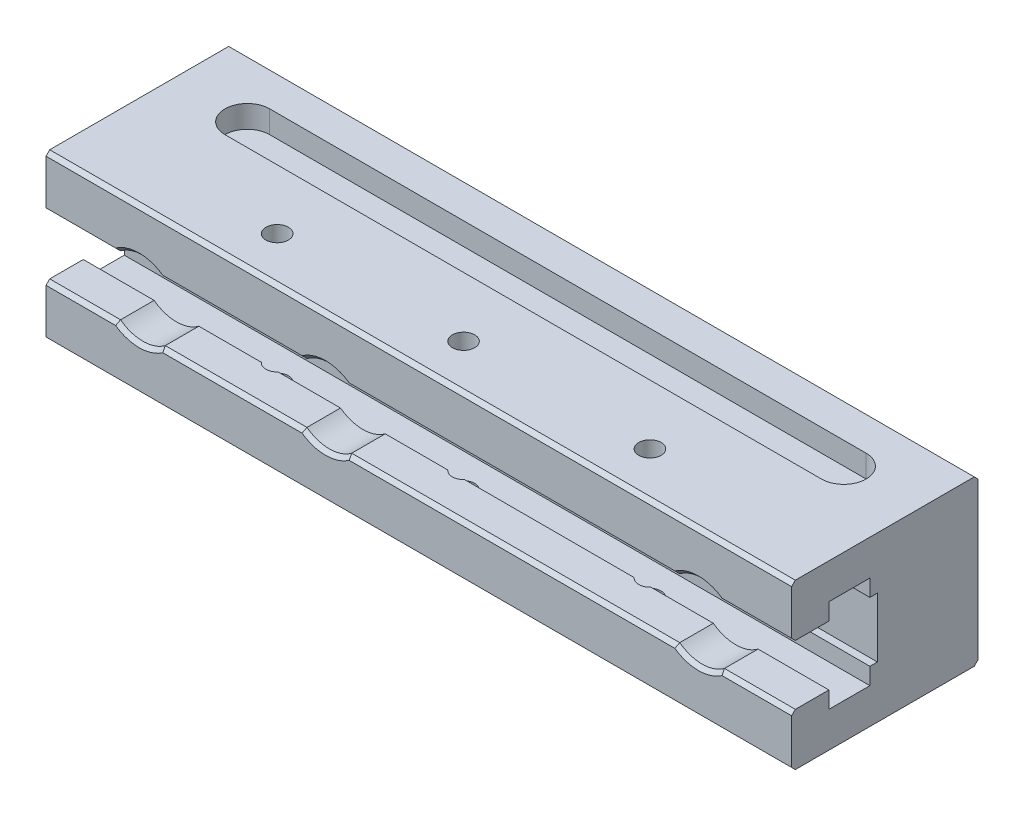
ISO-10303-21;
HEADER;
FILE_DESCRIPTION(('STEP AP214'),'2;1');
FILE_NAME('part.step','',(''),(''),'','','');
FILE_SCHEMA(('AUTOMOTIVE_DESIGN { 1 0 10303 214 1 1 1 1 }'));
ENDSEC;
DATA;
#1=APPLICATION_CONTEXT('core data for automotive mechanical design processes');
#2=APPLICATION_PROTOCOL_DEFINITION('international standard','automotive_design',2000,#1);
#3=PRODUCT_CONTEXT('',#1,'mechanical');
#4=PRODUCT('Part','Part','',(#3));
#5=PRODUCT_RELATED_PRODUCT_CATEGORY('part','',(#4));
#6=PRODUCT_DEFINITION_FORMATION('','',#4);
#7=PRODUCT_DEFINITION_CONTEXT('part definition',#1,'design');
#8=PRODUCT_DEFINITION('design','',#6,#7);
#9=PRODUCT_DEFINITION_SHAPE('','',#8);
#10=(LENGTH_UNIT() NAMED_UNIT(*) SI_UNIT(.MILLI.,.METRE.));
#11=(NAMED_UNIT(*) PLANE_ANGLE_UNIT() SI_UNIT($,.RADIAN.));
#12=(NAMED_UNIT(*) SI_UNIT($,.STERADIAN.) SOLID_ANGLE_UNIT());
#13=UNCERTAINTY_MEASURE_WITH_UNIT(LENGTH_MEASURE(1.E-05),#10,'distance_accuracy_value','');
#14=(GEOMETRIC_REPRESENTATION_CONTEXT(3) GLOBAL_UNCERTAINTY_ASSIGNED_CONTEXT((#13)) GLOBAL_UNIT_ASSIGNED_CONTEXT((#10,
#11,#12)) REPRESENTATION_CONTEXT('',''));
#15=CARTESIAN_POINT('',(0.,0.,0.));
#16=DIRECTION('',(0.,0.,1.));
#17=DIRECTION('',(1.,0.,0.));
#18=AXIS2_PLACEMENT_3D('',#15,#16,#17);
#19=CARTESIAN_POINT('',(-25.,-8.,40.));
#20=DIRECTION('',(0.,0.,1.));
#21=DIRECTION('',(0.,-1.,0.));
#22=AXIS2_PLACEMENT_3D('',#19,#20,#21);
#23=PLANE('',#22);
#24=DIRECTION('',(1.,0.,0.));
#25=VECTOR('',#24,1.);
#26=CARTESIAN_POINT('',(-25.,-8.,40.));
#27=LINE('',#26,#25);
#28=CARTESIAN_POINT('',(22.7639320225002,-8.,40.));
#29=VERTEX_POINT('',#28);
#30=CARTESIAN_POINT('',(6.,-8.,40.));
#31=VERTEX_POINT('',#30);
#32=EDGE_CURVE('E478',#29,#31,#27,.F.);
#33=ORIENTED_EDGE('',*,*,#32,.F.);
#34=DIRECTION('',(0.,-1.,0.));
#35=VECTOR('',#34,1.);
#36=CARTESIAN_POINT('',(22.7639320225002,22.,40.));
#37=LINE('',#36,#35);
#38=CARTESIAN_POINT('',(22.7639320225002,-12.5,40.));
#39=VERTEX_POINT('',#38);
#40=EDGE_CURVE('E465',#29,#39,#37,.T.);
#41=ORIENTED_EDGE('',*,*,#40,.T.);
#42=DIRECTION('',(1.,0.,0.));
#43=VECTOR('',#42,1.);
#44=CARTESIAN_POINT('',(-25.,-12.5,40.));
#45=LINE('',#44,#43);
#46=CARTESIAN_POINT('',(-25.,-12.5,40.));
#47=VERTEX_POINT('',#46);
#48=EDGE_CURVE('E475',#47,#39,#45,.T.);
#49=ORIENTED_EDGE('',*,*,#48,.F.);
#50=DIRECTION('',(0.,-1.,0.));
#51=VECTOR('',#50,1.);
#52=CARTESIAN_POINT('',(-25.,12.4820261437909,40.));
#53=LINE('',#52,#51);
#54=CARTESIAN_POINT('',(-25.,-8.,40.));
#55=VERTEX_POINT('',#54);
#56=EDGE_CURVE('E496',#55,#47,#53,.T.);
#57=ORIENTED_EDGE('',*,*,#56,.F.);
#58=DIRECTION('',(1.,0.,0.));
#59=VECTOR('',#58,1.);
#60=CARTESIAN_POINT('',(-25.,-8.,40.));
#61=LINE('',#60,#59);
#62=CARTESIAN_POINT('',(-6.,-8.,40.));
#63=VERTEX_POINT('',#62);
#64=EDGE_CURVE('E486',#63,#55,#61,.F.);
#65=ORIENTED_EDGE('',*,*,#64,.F.);
#66=CARTESIAN_POINT('',(0.,0.,40.));
#67=DIRECTION('',(0.,0.,-1.));
#68=DIRECTION('',(0.,1.,0.));
#69=AXIS2_PLACEMENT_3D('',#66,#67,#68);
#70=CIRCLE('',#69,10.);
#71=EDGE_CURVE('E490',#31,#63,#70,.T.);
#72=ORIENTED_EDGE('',*,*,#71,.F.);
#73=EDGE_LOOP('',(#33,#41,#49,#57,#65,#72));
#74=FACE_BOUND('',#73,.T.);
#75=ADVANCED_FACE('F14',(#74),#23,.F.);
#76=CARTESIAN_POINT('',(-25.,8.,40.));
#77=DIRECTION('',(0.,0.,-1.));
#78=DIRECTION('',(0.,1.,0.));
#79=AXIS2_PLACEMENT_3D('',#76,#77,#78);
#80=PLANE('',#79);
#81=DIRECTION('',(0.,-1.,0.));
#82=VECTOR('',#81,1.);
#83=CARTESIAN_POINT('',(27.2360679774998,22.,40.));
#84=LINE('',#83,#82);
#85=CARTESIAN_POINT('',(27.2360679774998,12.5,40.));
#86=VERTEX_POINT('',#85);
#87=CARTESIAN_POINT('',(27.2360679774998,8.,40.));
#88=VERTEX_POINT('',#87);
#89=EDGE_CURVE('E1844',#86,#88,#84,.T.);
#90=ORIENTED_EDGE('',*,*,#89,.F.);
#91=DIRECTION('',(1.,0.,0.));
#92=VECTOR('',#91,1.);
#93=CARTESIAN_POINT('',(-25.,12.5,40.));
#94=LINE('',#93,#92);
#95=CARTESIAN_POINT('',(72.7639320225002,12.5,40.));
#96=VERTEX_POINT('',#95);
#97=EDGE_CURVE('E784',#96,#86,#94,.F.);
#98=ORIENTED_EDGE('',*,*,#97,.F.);
#99=DIRECTION('',(0.,-1.,0.));
#100=VECTOR('',#99,1.);
#101=CARTESIAN_POINT('',(72.7639320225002,22.,40.));
#102=LINE('',#101,#100);
#103=CARTESIAN_POINT('',(72.7639320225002,8.,40.));
#104=VERTEX_POINT('',#103);
#105=EDGE_CURVE('E1864',#104,#96,#102,.F.);
#106=ORIENTED_EDGE('',*,*,#105,.F.);
#107=DIRECTION('',(1.,0.,0.));
#108=VECTOR('',#107,1.);
#109=CARTESIAN_POINT('',(-25.,8.,40.));
#110=LINE('',#109,#108);
#111=CARTESIAN_POINT('',(56.,8.,40.));
#112=VERTEX_POINT('',#111);
#113=EDGE_CURVE('E794',#104,#112,#110,.F.);
#114=ORIENTED_EDGE('',*,*,#113,.T.);
#115=CARTESIAN_POINT('',(50.,0.,40.));
#116=DIRECTION('',(0.,0.,1.));
#117=DIRECTION('',(0.,-1.,0.));
#118=AXIS2_PLACEMENT_3D('',#115,#116,#117);
#119=CIRCLE('',#118,10.);
#120=CARTESIAN_POINT('',(44.,8.,40.));
#121=VERTEX_POINT('',#120);
#122=EDGE_CURVE('E609',#112,#121,#119,.T.);
#123=ORIENTED_EDGE('',*,*,#122,.T.);
#124=DIRECTION('',(1.,0.,0.));
#125=VECTOR('',#124,1.);
#126=CARTESIAN_POINT('',(-25.,8.,40.));
#127=LINE('',#126,#125);
#128=EDGE_CURVE('E802',#121,#88,#127,.F.);
#129=ORIENTED_EDGE('',*,*,#128,.T.);
#130=EDGE_LOOP('',(#90,#98,#106,#114,#123,#129));
#131=FACE_BOUND('',#130,.T.);
#132=ADVANCED_FACE('F1179',(#131),#80,.T.);
#133=DIRECTION('',(1.,0.,0.));
#134=VECTOR('',#133,1.);
#135=CARTESIAN_POINT('',(-25.,-12.5,40.));
#136=LINE('',#135,#134);
#137=CARTESIAN_POINT('',(27.2360679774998,-12.5,40.));
#138=VERTEX_POINT('',#137);
#139=CARTESIAN_POINT('',(72.7639320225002,-12.5,40.));
#140=VERTEX_POINT('',#139);
#141=EDGE_CURVE('E485',#138,#140,#136,.T.);
#142=ORIENTED_EDGE('',*,*,#141,.F.);
#143=DIRECTION('',(0.,-1.,0.));
#144=VECTOR('',#143,1.);
#145=CARTESIAN_POINT('',(27.2360679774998,22.,40.));
#146=LINE('',#145,#144);
#147=CARTESIAN_POINT('',(27.2360679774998,-8.,40.));
#148=VERTEX_POINT('',#147);
#149=EDGE_CURVE('E39',#138,#148,#146,.F.);
#150=ORIENTED_EDGE('',*,*,#149,.T.);
#151=CARTESIAN_POINT('',(44.,-8.,40.));
#152=VERTEX_POINT('',#151);
#153=EDGE_CURVE('E748',#152,#148,#27,.F.);
#154=ORIENTED_EDGE('',*,*,#153,.F.);
#155=CARTESIAN_POINT('',(50.,0.,40.));
#156=DIRECTION('',(0.,0.,-1.));
#157=DIRECTION('',(0.,1.,0.));
#158=AXIS2_PLACEMENT_3D('',#155,#156,#157);
#159=CIRCLE('',#158,10.);
#160=CARTESIAN_POINT('',(56.,-8.,40.));
#161=VERTEX_POINT('',#160);
#162=EDGE_CURVE('E744',#161,#152,#159,.T.);
#163=ORIENTED_EDGE('',*,*,#162,.F.);
#164=DIRECTION('',(1.,0.,0.));
#165=VECTOR('',#164,1.);
#166=CARTESIAN_POINT('',(-25.,-8.,40.));
#167=LINE('',#166,#165);
#168=CARTESIAN_POINT('',(72.7639320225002,-8.,40.));
#169=VERTEX_POINT('',#168);
#170=EDGE_CURVE('E746',#169,#161,#167,.F.);
#171=ORIENTED_EDGE('',*,*,#170,.F.);
#172=DIRECTION('',(0.,-1.,0.));
#173=VECTOR('',#172,1.);
#174=CARTESIAN_POINT('',(72.7639320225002,22.,40.));
#175=LINE('',#174,#173);
#176=EDGE_CURVE('E1856',#169,#140,#175,.T.);
#177=ORIENTED_EDGE('',*,*,#176,.T.);
#178=EDGE_LOOP('',(#142,#150,#154,#163,#171,#177));
#179=FACE_BOUND('',#178,.T.);
#180=ADVANCED_FACE('F1181',(#179),#23,.F.);
#181=DIRECTION('',(0.,-1.,0.));
#182=VECTOR('',#181,1.);
#183=CARTESIAN_POINT('',(77.2360679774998,22.,40.));
#184=LINE('',#183,#182);
#185=CARTESIAN_POINT('',(77.2360679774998,12.5,40.));
#186=VERTEX_POINT('',#185);
#187=CARTESIAN_POINT('',(77.2360679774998,8.,40.));
#188=VERTEX_POINT('',#187);
#189=EDGE_CURVE('E1866',#186,#188,#184,.T.);
#190=ORIENTED_EDGE('',*,*,#189,.F.);
#191=DIRECTION('',(1.,0.,0.));
#192=VECTOR('',#191,1.);
#193=CARTESIAN_POINT('',(-25.,12.5,40.));
#194=LINE('',#193,#192);
#195=CARTESIAN_POINT('',(122.7639320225,12.5,40.));
#196=VERTEX_POINT('',#195);
#197=EDGE_CURVE('E787',#196,#186,#194,.F.);
#198=ORIENTED_EDGE('',*,*,#197,.F.);
#199=DIRECTION('',(0.,-1.,0.));
#200=VECTOR('',#199,1.);
#201=CARTESIAN_POINT('',(122.7639320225,22.,40.));
#202=LINE('',#201,#200);
#203=CARTESIAN_POINT('',(122.7639320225,8.,40.));
#204=VERTEX_POINT('',#203);
#205=EDGE_CURVE('E952',#204,#196,#202,.F.);
#206=ORIENTED_EDGE('',*,*,#205,.F.);
#207=EDGE_CURVE('E793',#204,#188,#110,.F.);
#208=ORIENTED_EDGE('',*,*,#207,.T.);
#209=EDGE_LOOP('',(#190,#198,#206,#208));
#210=FACE_BOUND('',#209,.T.);
#211=ADVANCED_FACE('F1188',(#210),#80,.T.);
#212=DIRECTION('',(0.,-1.,0.));
#213=VECTOR('',#212,1.);
#214=CARTESIAN_POINT('',(127.2360679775,22.,40.));
#215=LINE('',#214,#213);
#216=CARTESIAN_POINT('',(127.2360679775,12.5,40.));
#217=VERTEX_POINT('',#216);
#218=CARTESIAN_POINT('',(127.2360679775,8.,40.));
#219=VERTEX_POINT('',#218);
#220=EDGE_CURVE('E957',#217,#219,#215,.T.);
#221=ORIENTED_EDGE('',*,*,#220,.F.);
#222=DIRECTION('',(1.,0.,0.));
#223=VECTOR('',#222,1.);
#224=CARTESIAN_POINT('',(-25.,12.5,40.));
#225=LINE('',#224,#223);
#226=CARTESIAN_POINT('',(175.,12.5,40.));
#227=VERTEX_POINT('',#226);
#228=EDGE_CURVE('E779',#227,#217,#225,.F.);
#229=ORIENTED_EDGE('',*,*,#228,.F.);
#230=DIRECTION('',(0.,-1.,0.));
#231=VECTOR('',#230,1.);
#232=CARTESIAN_POINT('',(175.,12.4820261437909,40.));
#233=LINE('',#232,#231);
#234=CARTESIAN_POINT('',(175.,8.,40.));
#235=VERTEX_POINT('',#234);
#236=EDGE_CURVE('E589',#235,#227,#233,.F.);
#237=ORIENTED_EDGE('',*,*,#236,.F.);
#238=DIRECTION('',(1.,0.,0.));
#239=VECTOR('',#238,1.);
#240=CARTESIAN_POINT('',(-25.,8.,40.));
#241=LINE('',#240,#239);
#242=CARTESIAN_POINT('',(156.,8.,40.));
#243=VERTEX_POINT('',#242);
#244=EDGE_CURVE('E795',#235,#243,#241,.F.);
#245=ORIENTED_EDGE('',*,*,#244,.T.);
#246=CARTESIAN_POINT('',(150.,0.,40.));
#247=DIRECTION('',(0.,0.,1.));
#248=DIRECTION('',(0.,-1.,0.));
#249=AXIS2_PLACEMENT_3D('',#246,#247,#248);
#250=CIRCLE('',#249,10.);
#251=CARTESIAN_POINT('',(144.,8.,40.));
#252=VERTEX_POINT('',#251);
#253=EDGE_CURVE('E798',#243,#252,#250,.T.);
#254=ORIENTED_EDGE('',*,*,#253,.T.);
#255=EDGE_CURVE('E790',#252,#219,#110,.F.);
#256=ORIENTED_EDGE('',*,*,#255,.T.);
#257=EDGE_LOOP('',(#221,#229,#237,#245,#254,#256));
#258=FACE_BOUND('',#257,.T.);
#259=ADVANCED_FACE('F1204',(#258),#80,.T.);
#260=DIRECTION('',(1.,0.,0.));
#261=VECTOR('',#260,1.);
#262=CARTESIAN_POINT('',(-25.,-12.5,40.));
#263=LINE('',#262,#261);
#264=CARTESIAN_POINT('',(77.2360679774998,-12.5,40.));
#265=VERTEX_POINT('',#264);
#266=CARTESIAN_POINT('',(122.7639320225,-12.5,40.));
#267=VERTEX_POINT('',#266);
#268=EDGE_CURVE('E488',#265,#267,#263,.T.);
#269=ORIENTED_EDGE('',*,*,#268,.F.);
#270=DIRECTION('',(0.,-1.,0.));
#271=VECTOR('',#270,1.);
#272=CARTESIAN_POINT('',(77.2360679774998,22.,40.));
#273=LINE('',#272,#271);
#274=CARTESIAN_POINT('',(77.2360679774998,-8.,40.));
#275=VERTEX_POINT('',#274);
#276=EDGE_CURVE('E1854',#265,#275,#273,.F.);
#277=ORIENTED_EDGE('',*,*,#276,.T.);
#278=CARTESIAN_POINT('',(122.7639320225,-8.,40.));
#279=VERTEX_POINT('',#278);
#280=EDGE_CURVE('E745',#279,#275,#167,.F.);
#281=ORIENTED_EDGE('',*,*,#280,.F.);
#282=DIRECTION('',(0.,-1.,0.));
#283=VECTOR('',#282,1.);
#284=CARTESIAN_POINT('',(122.7639320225,22.,40.));
#285=LINE('',#284,#283);
#286=EDGE_CURVE('E941',#279,#267,#285,.T.);
#287=ORIENTED_EDGE('',*,*,#286,.T.);
#288=EDGE_LOOP('',(#269,#277,#281,#287));
#289=FACE_BOUND('',#288,.T.);
#290=ADVANCED_FACE('F948',(#289),#23,.F.);
#291=CARTESIAN_POINT('',(75.,16.,16.));
#292=DIRECTION('',(0.,-1.,0.));
#293=DIRECTION('',(0.,0.,-1.));
#294=AXIS2_PLACEMENT_3D('',#291,#292,#293);
#295=PLANE('',#294);
#296=DIRECTION('',(1.,0.,0.));
#297=VECTOR('',#296,1.);
#298=CARTESIAN_POINT('',(-5.,16.,10.));
#299=LINE('',#298,#297);
#300=CARTESIAN_POINT('',(155.,16.,10.));
#301=VERTEX_POINT('',#300);
#302=CARTESIAN_POINT('',(-5.,16.,10.));
#303=VERTEX_POINT('',#302);
#304=EDGE_CURVE('E961',#301,#303,#299,.F.);
#305=ORIENTED_EDGE('',*,*,#304,.T.);
#306=CARTESIAN_POINT('',(-5.,16.,16.));
#307=DIRECTION('',(0.,-1.,0.));
#308=DIRECTION('',(0.,0.,-1.));
#309=AXIS2_PLACEMENT_3D('',#306,#307,#308);
#310=CIRCLE('',#309,6.);
#311=CARTESIAN_POINT('',(-5.,16.,22.));
#312=VERTEX_POINT('',#311);
#313=EDGE_CURVE('E1041',#303,#312,#310,.F.);
#314=ORIENTED_EDGE('',*,*,#313,.T.);
#315=DIRECTION('',(-1.,0.,0.));
#316=VECTOR('',#315,1.);
#317=CARTESIAN_POINT('',(155.,16.,22.));
#318=LINE('',#317,#316);
#319=CARTESIAN_POINT('',(155.,16.,22.));
#320=VERTEX_POINT('',#319);
#321=EDGE_CURVE('E1055',#312,#320,#318,.F.);
#322=ORIENTED_EDGE('',*,*,#321,.T.);
#323=CARTESIAN_POINT('',(155.,16.,16.));
#324=DIRECTION('',(0.,-1.,0.));
#325=DIRECTION('',(0.,0.,-1.));
#326=AXIS2_PLACEMENT_3D('',#323,#324,#325);
#327=CIRCLE('',#326,6.00000000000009);
#328=EDGE_CURVE('E18',#320,#301,#327,.F.);
#329=ORIENTED_EDGE('',*,*,#328,.T.);
#330=EDGE_LOOP('',(#305,#314,#322,#329));
#331=FACE_BOUND('',#330,.T.);
#332=ADVANCED_FACE('F16',(#331),#295,.F.);
#333=CARTESIAN_POINT('',(75.,-16.,16.));
#334=DIRECTION('',(0.,-1.,0.));
#335=DIRECTION('',(0.,0.,-1.));
#336=AXIS2_PLACEMENT_3D('',#333,#334,#335);
#337=PLANE('',#336);
#338=CARTESIAN_POINT('',(-5.,-16.,16.));
#339=DIRECTION('',(0.,-1.,0.));
#340=DIRECTION('',(0.,0.,-1.));
#341=AXIS2_PLACEMENT_3D('',#338,#339,#340);
#342=CIRCLE('',#341,6.);
#343=CARTESIAN_POINT('',(-5.,-16.,22.));
#344=VERTEX_POINT('',#343);
#345=CARTESIAN_POINT('',(-5.,-16.,10.));
#346=VERTEX_POINT('',#345);
#347=EDGE_CURVE('E841',#344,#346,#342,.T.);
#348=ORIENTED_EDGE('',*,*,#347,.T.);
#349=DIRECTION('',(-1.,0.,0.));
#350=VECTOR('',#349,1.);
#351=CARTESIAN_POINT('',(-5.,-16.,10.));
#352=LINE('',#351,#350);
#353=CARTESIAN_POINT('',(155.,-16.,10.));
#354=VERTEX_POINT('',#353);
#355=EDGE_CURVE('E837',#354,#346,#352,.T.);
#356=ORIENTED_EDGE('',*,*,#355,.F.);
#357=CARTESIAN_POINT('',(155.,-16.,16.));
#358=DIRECTION('',(0.,-1.,0.));
#359=DIRECTION('',(0.,0.,-1.));
#360=AXIS2_PLACEMENT_3D('',#357,#358,#359);
#361=CIRCLE('',#360,6.00000000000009);
#362=CARTESIAN_POINT('',(155.,-16.,22.));
#363=VERTEX_POINT('',#362);
#364=EDGE_CURVE('E851',#354,#363,#361,.T.);
#365=ORIENTED_EDGE('',*,*,#364,.T.);
#366=DIRECTION('',(1.,0.,0.));
#367=VECTOR('',#366,1.);
#368=CARTESIAN_POINT('',(155.,-16.,22.));
#369=LINE('',#368,#367);
#370=EDGE_CURVE('E848',#344,#363,#369,.T.);
#371=ORIENTED_EDGE('',*,*,#370,.F.);
#372=EDGE_LOOP('',(#348,#356,#365,#371));
#373=FACE_BOUND('',#372,.T.);
#374=ADVANCED_FACE('F1167',(#373),#337,.T.);
#375=CARTESIAN_POINT('',(-25.,8.,27.));
#376=DIRECTION('',(0.,0.,1.));
#377=DIRECTION('',(0.,-1.,0.));
#378=AXIS2_PLACEMENT_3D('',#375,#376,#377);
#379=PLANE('',#378);
#380=CARTESIAN_POINT('',(0.,0.,27.));
#381=DIRECTION('',(0.,0.,1.));
#382=DIRECTION('',(0.,-1.,0.));
#383=AXIS2_PLACEMENT_3D('',#380,#381,#382);
#384=CIRCLE('',#383,10.);
#385=CARTESIAN_POINT('',(6.,8.,27.));
#386=VERTEX_POINT('',#385);
#387=CARTESIAN_POINT('',(6.,-8.,27.));
#388=VERTEX_POINT('',#387);
#389=EDGE_CURVE('E514',#386,#388,#384,.F.);
#390=ORIENTED_EDGE('',*,*,#389,.T.);
#391=DIRECTION('',(1.,0.,0.));
#392=VECTOR('',#391,1.);
#393=CARTESIAN_POINT('',(-25.,-8.,27.));
#394=LINE('',#393,#392);
#395=CARTESIAN_POINT('',(44.,-8.,27.));
#396=VERTEX_POINT('',#395);
#397=EDGE_CURVE('E510',#388,#396,#394,.T.);
#398=ORIENTED_EDGE('',*,*,#397,.T.);
#399=CARTESIAN_POINT('',(50.,0.,27.));
#400=DIRECTION('',(0.,0.,1.));
#401=DIRECTION('',(0.,-1.,0.));
#402=AXIS2_PLACEMENT_3D('',#399,#400,#401);
#403=CIRCLE('',#402,10.);
#404=CARTESIAN_POINT('',(44.,8.,27.));
#405=VERTEX_POINT('',#404);
#406=EDGE_CURVE('E517',#396,#405,#403,.F.);
#407=ORIENTED_EDGE('',*,*,#406,.T.);
#408=DIRECTION('',(1.,0.,0.));
#409=VECTOR('',#408,1.);
#410=CARTESIAN_POINT('',(-25.,8.,27.));
#411=LINE('',#410,#409);
#412=EDGE_CURVE('E1073',#386,#405,#411,.T.);
#413=ORIENTED_EDGE('',*,*,#412,.F.);
#414=EDGE_LOOP('',(#390,#398,#407,#413));
#415=FACE_BOUND('',#414,.T.);
#416=ADVANCED_FACE('F1164',(#415),#379,.T.);
#417=CARTESIAN_POINT('',(-25.,8.,27.));
#418=DIRECTION('',(0.,0.,1.));
#419=DIRECTION('',(0.,-1.,0.));
#420=AXIS2_PLACEMENT_3D('',#417,#418,#419);
#421=PLANE('',#420);
#422=CARTESIAN_POINT('',(150.,0.,27.));
#423=DIRECTION('',(0.,0.,1.));
#424=DIRECTION('',(0.,-1.,0.));
#425=AXIS2_PLACEMENT_3D('',#422,#423,#424);
#426=CIRCLE('',#425,10.);
#427=CARTESIAN_POINT('',(144.,-8.,27.));
#428=VERTEX_POINT('',#427);
#429=CARTESIAN_POINT('',(144.,8.,27.));
#430=VERTEX_POINT('',#429);
#431=EDGE_CURVE('E547',#428,#430,#426,.F.);
#432=ORIENTED_EDGE('',*,*,#431,.T.);
#433=DIRECTION('',(1.,0.,0.));
#434=VECTOR('',#433,1.);
#435=CARTESIAN_POINT('',(-25.,8.,27.));
#436=LINE('',#435,#434);
#437=CARTESIAN_POINT('',(56.,8.,27.));
#438=VERTEX_POINT('',#437);
#439=EDGE_CURVE('E602',#438,#430,#436,.T.);
#440=ORIENTED_EDGE('',*,*,#439,.F.);
#441=CARTESIAN_POINT('',(50.,0.,27.));
#442=DIRECTION('',(0.,0.,1.));
#443=DIRECTION('',(0.,-1.,0.));
#444=AXIS2_PLACEMENT_3D('',#441,#442,#443);
#445=CIRCLE('',#444,10.);
#446=CARTESIAN_POINT('',(56.,-8.,27.));
#447=VERTEX_POINT('',#446);
#448=EDGE_CURVE('E548',#438,#447,#445,.F.);
#449=ORIENTED_EDGE('',*,*,#448,.T.);
#450=DIRECTION('',(1.,0.,0.));
#451=VECTOR('',#450,1.);
#452=CARTESIAN_POINT('',(-25.,-8.,27.));
#453=LINE('',#452,#451);
#454=EDGE_CURVE('E1074',#447,#428,#453,.T.);
#455=ORIENTED_EDGE('',*,*,#454,.T.);
#456=EDGE_LOOP('',(#432,#440,#449,#455));
#457=FACE_BOUND('',#456,.T.);
#458=ADVANCED_FACE('F1166',(#457),#421,.T.);
#459=CARTESIAN_POINT('',(-5.,22.,10.));
#460=DIRECTION('',(0.,0.,-1.));
#461=DIRECTION('',(1.,0.,0.));
#462=AXIS2_PLACEMENT_3D('',#459,#460,#461);
#463=PLANE('',#462);
#464=DIRECTION('',(0.,-1.,0.));
#465=VECTOR('',#464,1.);
#466=CARTESIAN_POINT('',(-5.,22.,10.0000000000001));
#467=LINE('',#466,#465);
#468=CARTESIAN_POINT('',(-5.,22.,10.0000000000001));
#469=VERTEX_POINT('',#468);
#470=EDGE_CURVE('E1043',#469,#303,#467,.T.);
#471=ORIENTED_EDGE('',*,*,#470,.T.);
#472=ORIENTED_EDGE('',*,*,#304,.F.);
#473=DIRECTION('',(0.,-1.,0.));
#474=VECTOR('',#473,1.);
#475=CARTESIAN_POINT('',(155.,22.,10.));
#476=LINE('',#475,#474);
#477=CARTESIAN_POINT('',(155.,22.,10.));
#478=VERTEX_POINT('',#477);
#479=EDGE_CURVE('E1059',#301,#478,#476,.F.);
#480=ORIENTED_EDGE('',*,*,#479,.T.);
#481=DIRECTION('',(1.,0.,0.));
#482=VECTOR('',#481,1.);
#483=CARTESIAN_POINT('',(-25.,22.,10.));
#484=LINE('',#483,#482);
#485=EDGE_CURVE('E828',#469,#478,#484,.T.);
#486=ORIENTED_EDGE('',*,*,#485,.F.);
#487=EDGE_LOOP('',(#471,#472,#480,#486));
#488=FACE_BOUND('',#487,.T.);
#489=ADVANCED_FACE('F1174',(#488),#463,.F.);
#490=CARTESIAN_POINT('',(155.,22.,16.));
#491=DIRECTION('',(0.,-1.,0.));
#492=DIRECTION('',(0.,0.,-1.));
#493=AXIS2_PLACEMENT_3D('',#490,#491,#492);
#494=CYLINDRICAL_SURFACE('',#493,6.00000000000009);
#495=ORIENTED_EDGE('',*,*,#479,.F.);
#496=ORIENTED_EDGE('',*,*,#328,.F.);
#497=DIRECTION('',(0.,-1.,0.));
#498=VECTOR('',#497,1.);
#499=CARTESIAN_POINT('',(155.,22.,22.));
#500=LINE('',#499,#498);
#501=CARTESIAN_POINT('',(155.,22.,22.));
#502=VERTEX_POINT('',#501);
#503=EDGE_CURVE('E1050',#320,#502,#500,.F.);
#504=ORIENTED_EDGE('',*,*,#503,.T.);
#505=CARTESIAN_POINT('',(155.,22.,16.));
#506=DIRECTION('',(0.,-1.,0.));
#507=DIRECTION('',(0.,0.,-1.));
#508=AXIS2_PLACEMENT_3D('',#505,#506,#507);
#509=CIRCLE('',#508,6.00000000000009);
#510=EDGE_CURVE('E827',#478,#502,#509,.T.);
#511=ORIENTED_EDGE('',*,*,#510,.F.);
#512=EDGE_LOOP('',(#495,#496,#504,#511));
#513=FACE_BOUND('',#512,.T.);
#514=ADVANCED_FACE('F1312',(#513),#494,.F.);
#515=CARTESIAN_POINT('',(155.,22.,22.));
#516=DIRECTION('',(0.,0.,1.));
#517=DIRECTION('',(-1.,0.,0.));
#518=AXIS2_PLACEMENT_3D('',#515,#516,#517);
#519=PLANE('',#518);
#520=ORIENTED_EDGE('',*,*,#503,.F.);
#521=ORIENTED_EDGE('',*,*,#321,.F.);
#522=DIRECTION('',(0.,-1.,0.));
#523=VECTOR('',#522,1.);
#524=CARTESIAN_POINT('',(-5.,22.,22.));
#525=LINE('',#524,#523);
#526=CARTESIAN_POINT('',(-5.,22.,22.));
#527=VERTEX_POINT('',#526);
#528=EDGE_CURVE('E1042',#312,#527,#525,.F.);
#529=ORIENTED_EDGE('',*,*,#528,.T.);
#530=DIRECTION('',(1.,0.,0.));
#531=VECTOR('',#530,1.);
#532=CARTESIAN_POINT('',(-25.,22.,22.));
#533=LINE('',#532,#531);
#534=EDGE_CURVE('E824',#502,#527,#533,.F.);
#535=ORIENTED_EDGE('',*,*,#534,.F.);
#536=EDGE_LOOP('',(#520,#521,#529,#535));
#537=FACE_BOUND('',#536,.T.);
#538=ADVANCED_FACE('F1308',(#537),#519,.F.);
#539=CARTESIAN_POINT('',(-5.,22.,16.));
#540=DIRECTION('',(0.,-1.,0.));
#541=DIRECTION('',(0.,0.,-1.));
#542=AXIS2_PLACEMENT_3D('',#539,#540,#541);
#543=CYLINDRICAL_SURFACE('',#542,6.);
#544=ORIENTED_EDGE('',*,*,#528,.F.);
#545=ORIENTED_EDGE('',*,*,#313,.F.);
#546=ORIENTED_EDGE('',*,*,#470,.F.);
#547=CARTESIAN_POINT('',(-5.,22.,16.));
#548=DIRECTION('',(0.,-1.,0.));
#549=DIRECTION('',(0.,0.,-1.));
#550=AXIS2_PLACEMENT_3D('',#547,#548,#549);
#551=CIRCLE('',#550,6.);
#552=EDGE_CURVE('E823',#527,#469,#551,.T.);
#553=ORIENTED_EDGE('',*,*,#552,.F.);
#554=EDGE_LOOP('',(#544,#545,#546,#553));
#555=FACE_BOUND('',#554,.T.);
#556=ADVANCED_FACE('F1305',(#555),#543,.F.);
#557=CARTESIAN_POINT('',(-25.,21.5,49.5));
#558=DIRECTION('',(0.,0.707106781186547,0.707106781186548));
#559=DIRECTION('',(0.,-0.707106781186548,0.707106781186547));
#560=AXIS2_PLACEMENT_3D('',#557,#558,#559);
#561=PLANE('',#560);
#562=DIRECTION('',(0.,-0.707106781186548,0.707106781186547));
#563=VECTOR('',#562,1.);
#564=CARTESIAN_POINT('',(-25.,21.5,49.5));
#565=LINE('',#564,#563);
#566=CARTESIAN_POINT('',(-25.,22.,49.));
#567=VERTEX_POINT('',#566);
#568=CARTESIAN_POINT('',(-25.,21.,50.));
#569=VERTEX_POINT('',#568);
#570=EDGE_CURVE('E1278',#567,#569,#565,.T.);
#571=ORIENTED_EDGE('',*,*,#570,.T.);
#572=DIRECTION('',(1.,0.,0.));
#573=VECTOR('',#572,1.);
#574=CARTESIAN_POINT('',(-25.,21.,50.));
#575=LINE('',#574,#573);
#576=CARTESIAN_POINT('',(175.,21.,50.));
#577=VERTEX_POINT('',#576);
#578=EDGE_CURVE('E820',#577,#569,#575,.F.);
#579=ORIENTED_EDGE('',*,*,#578,.F.);
#580=DIRECTION('',(0.,-0.707106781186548,0.707106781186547));
#581=VECTOR('',#580,1.);
#582=CARTESIAN_POINT('',(175.,21.5,49.5));
#583=LINE('',#582,#581);
#584=CARTESIAN_POINT('',(175.,22.,49.));
#585=VERTEX_POINT('',#584);
#586=EDGE_CURVE('E1047',#577,#585,#583,.F.);
#587=ORIENTED_EDGE('',*,*,#586,.T.);
#588=DIRECTION('',(1.,0.,0.));
#589=VECTOR('',#588,1.);
#590=CARTESIAN_POINT('',(-25.,22.,49.));
#591=LINE('',#590,#589);
#592=EDGE_CURVE('E617',#567,#585,#591,.T.);
#593=ORIENTED_EDGE('',*,*,#592,.F.);
#594=EDGE_LOOP('',(#571,#579,#587,#593));
#595=FACE_BOUND('',#594,.T.);
#596=ADVANCED_FACE('F1276',(#595),#561,.T.);
#597=CARTESIAN_POINT('',(-25.,8.5,49.5));
#598=DIRECTION('',(0.,-0.707106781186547,0.707106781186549));
#599=DIRECTION('',(0.,-0.707106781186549,-0.707106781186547));
#600=AXIS2_PLACEMENT_3D('',#597,#598,#599);
#601=PLANE('',#600);
#602=DIRECTION('',(1.,0.,0.));
#603=VECTOR('',#602,1.);
#604=CARTESIAN_POINT('',(-25.,8.,49.));
#605=LINE('',#604,#603);
#606=CARTESIAN_POINT('',(-6.,8.,49.));
#607=VERTEX_POINT('',#606);
#608=CARTESIAN_POINT('',(-25.,8.,49.));
#609=VERTEX_POINT('',#608);
#610=EDGE_CURVE('E618',#607,#609,#605,.F.);
#611=ORIENTED_EDGE('',*,*,#610,.F.);
#612=CARTESIAN_POINT('',(-5.99999999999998,8.,49.));
#613=CARTESIAN_POINT('',(-6.16227766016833,8.48683298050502,49.486832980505));
#614=CARTESIAN_POINT('',(-6.32455532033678,9.,50.));
#615=B_SPLINE_CURVE_WITH_KNOTS('',2,(#612,#613,#614),.UNSPECIFIED.,.F.,.F.,(3,3),(0.,1.),.UNSPECIFIED.);
#616=CARTESIAN_POINT('',(-6.32455532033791,9.,49.9999999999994));
#617=VERTEX_POINT('',#616);
#618=EDGE_CURVE('E1285',#607,#617,#615,.T.);
#619=ORIENTED_EDGE('',*,*,#618,.T.);
#620=DIRECTION('',(1.,0.,0.));
#621=VECTOR('',#620,1.);
#622=CARTESIAN_POINT('',(-25.,9.,50.));
#623=LINE('',#622,#621);
#624=CARTESIAN_POINT('',(-25.,9.,50.));
#625=VERTEX_POINT('',#624);
#626=EDGE_CURVE('E817',#625,#617,#623,.T.);
#627=ORIENTED_EDGE('',*,*,#626,.F.);
#628=DIRECTION('',(0.,-0.707106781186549,-0.707106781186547));
#629=VECTOR('',#628,1.);
#630=CARTESIAN_POINT('',(-25.,8.5,49.5));
#631=LINE('',#630,#629);
#632=EDGE_CURVE('E1279',#625,#609,#631,.T.);
#633=ORIENTED_EDGE('',*,*,#632,.T.);
#634=EDGE_LOOP('',(#611,#619,#627,#633));
#635=FACE_BOUND('',#634,.T.);
#636=ADVANCED_FACE('F1291',(#635),#601,.T.);
#637=CARTESIAN_POINT('',(0.,0.,49.9999999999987));
#638=DIRECTION('',(0.,0.,1.));
#639=DIRECTION('',(-1.,0.,0.));
#640=AXIS2_PLACEMENT_3D('',#637,#638,#639);
#641=CONICAL_SURFACE('',#640,11.0000000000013,0.785398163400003);
#642=ORIENTED_EDGE('',*,*,#618,.F.);
#643=CARTESIAN_POINT('',(0.,0.,49.));
#644=DIRECTION('',(0.,0.,1.));
#645=DIRECTION('',(0.,-1.,0.));
#646=AXIS2_PLACEMENT_3D('',#643,#644,#645);
#647=CIRCLE('',#646,10.);
#648=CARTESIAN_POINT('',(6.,8.,49.));
#649=VERTEX_POINT('',#648);
#650=EDGE_CURVE('E625',#607,#649,#647,.F.);
#651=ORIENTED_EDGE('',*,*,#650,.T.);
#652=CARTESIAN_POINT('',(6.32455532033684,9.,50.));
#653=CARTESIAN_POINT('',(6.16227766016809,8.48683298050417,49.4868329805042));
#654=CARTESIAN_POINT('',(6.00000000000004,8.,49.));
#655=B_SPLINE_CURVE_WITH_KNOTS('',2,(#652,#653,#654),.UNSPECIFIED.,.F.,.F.,(3,3),(0.,1.),.UNSPECIFIED.);
#656=CARTESIAN_POINT('',(6.32455532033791,9.,49.9999999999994));
#657=VERTEX_POINT('',#656);
#658=EDGE_CURVE('E1289',#657,#649,#655,.T.);
#659=ORIENTED_EDGE('',*,*,#658,.F.);
#660=CARTESIAN_POINT('',(0.,0.,49.9999999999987));
#661=DIRECTION('',(0.,0.,1.));
#662=DIRECTION('',(-1.,0.,0.));
#663=AXIS2_PLACEMENT_3D('',#660,#661,#662);
#664=CIRCLE('',#663,11.0000000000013);
#665=EDGE_CURVE('E816',#617,#657,#664,.F.);
#666=ORIENTED_EDGE('',*,*,#665,.F.);
#667=EDGE_LOOP('',(#642,#651,#659,#666));
#668=FACE_BOUND('',#667,.T.);
#669=ADVANCED_FACE('F1301',(#668),#641,.F.);
#670=CARTESIAN_POINT('',(-25.,8.5,49.5));
#671=DIRECTION('',(0.,-0.707106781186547,0.707106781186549));
#672=DIRECTION('',(0.,-0.707106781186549,-0.707106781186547));
#673=AXIS2_PLACEMENT_3D('',#670,#671,#672);
#674=PLANE('',#673);
#675=DIRECTION('',(1.,0.,0.));
#676=VECTOR('',#675,1.);
#677=CARTESIAN_POINT('',(-25.,8.,49.));
#678=LINE('',#677,#676);
#679=CARTESIAN_POINT('',(44.,8.,49.));
#680=VERTEX_POINT('',#679);
#681=EDGE_CURVE('E629',#680,#649,#678,.F.);
#682=ORIENTED_EDGE('',*,*,#681,.F.);
#683=CARTESIAN_POINT('',(44.0000000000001,8.,49.));
#684=CARTESIAN_POINT('',(43.8377223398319,8.48683298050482,49.4868329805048));
#685=CARTESIAN_POINT('',(43.6754446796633,9.,50.));
#686=B_SPLINE_CURVE_WITH_KNOTS('',2,(#683,#684,#685),.UNSPECIFIED.,.F.,.F.,(3,3),(0.,1.),.UNSPECIFIED.);
#687=CARTESIAN_POINT('',(43.6754446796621,9.,49.9999999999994));
#688=VERTEX_POINT('',#687);
#689=EDGE_CURVE('E676',#680,#688,#686,.T.);
#690=ORIENTED_EDGE('',*,*,#689,.T.);
#691=DIRECTION('',(1.,0.,0.));
#692=VECTOR('',#691,1.);
#693=CARTESIAN_POINT('',(-25.,9.,50.));
#694=LINE('',#693,#692);
#695=EDGE_CURVE('E813',#657,#688,#694,.T.);
#696=ORIENTED_EDGE('',*,*,#695,.F.);
#697=ORIENTED_EDGE('',*,*,#658,.T.);
#698=EDGE_LOOP('',(#682,#690,#696,#697));
#699=FACE_BOUND('',#698,.T.);
#700=ADVANCED_FACE('F1350',(#699),#674,.T.);
#701=CARTESIAN_POINT('',(50.,0.,49.9999999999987));
#702=DIRECTION('',(0.,0.,1.));
#703=DIRECTION('',(-1.,0.,0.));
#704=AXIS2_PLACEMENT_3D('',#701,#702,#703);
#705=CONICAL_SURFACE('',#704,11.0000000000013,0.785398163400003);
#706=ORIENTED_EDGE('',*,*,#689,.F.);
#707=CARTESIAN_POINT('',(50.,0.,49.));
#708=DIRECTION('',(0.,0.,1.));
#709=DIRECTION('',(0.,-1.,0.));
#710=AXIS2_PLACEMENT_3D('',#707,#708,#709);
#711=CIRCLE('',#710,10.);
#712=CARTESIAN_POINT('',(56.,8.,49.));
#713=VERTEX_POINT('',#712);
#714=EDGE_CURVE('E640',#680,#713,#711,.F.);
#715=ORIENTED_EDGE('',*,*,#714,.T.);
#716=CARTESIAN_POINT('',(56.3245553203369,9.,50.));
#717=CARTESIAN_POINT('',(56.1622776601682,8.48683298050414,49.4868329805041));
#718=CARTESIAN_POINT('',(56.0000000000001,8.,49.));
#719=B_SPLINE_CURVE_WITH_KNOTS('',2,(#716,#717,#718),.UNSPECIFIED.,.F.,.F.,(3,3),(0.,1.),.UNSPECIFIED.);
#720=CARTESIAN_POINT('',(56.3245553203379,9.,49.9999999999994));
#721=VERTEX_POINT('',#720);
#722=EDGE_CURVE('E673',#721,#713,#719,.T.);
#723=ORIENTED_EDGE('',*,*,#722,.F.);
#724=CARTESIAN_POINT('',(50.,0.,49.9999999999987));
#725=DIRECTION('',(0.,0.,1.));
#726=DIRECTION('',(-1.,0.,0.));
#727=AXIS2_PLACEMENT_3D('',#724,#725,#726);
#728=CIRCLE('',#727,11.0000000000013);
#729=EDGE_CURVE('E812',#688,#721,#728,.F.);
#730=ORIENTED_EDGE('',*,*,#729,.F.);
#731=EDGE_LOOP('',(#706,#715,#723,#730));
#732=FACE_BOUND('',#731,.T.);
#733=ADVANCED_FACE('F664',(#732),#705,.F.);
#734=CARTESIAN_POINT('',(-25.,8.5,49.5));
#735=DIRECTION('',(0.,-0.707106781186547,0.707106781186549));
#736=DIRECTION('',(0.,-0.707106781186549,-0.707106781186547));
#737=AXIS2_PLACEMENT_3D('',#734,#735,#736);
#738=PLANE('',#737);
#739=DIRECTION('',(1.,0.,0.));
#740=VECTOR('',#739,1.);
#741=CARTESIAN_POINT('',(-25.,8.,49.));
#742=LINE('',#741,#740);
#743=CARTESIAN_POINT('',(144.,8.,49.));
#744=VERTEX_POINT('',#743);
#745=EDGE_CURVE('E606',#744,#713,#742,.F.);
#746=ORIENTED_EDGE('',*,*,#745,.F.);
#747=CARTESIAN_POINT('',(144.,8.,49.));
#748=CARTESIAN_POINT('',(143.837722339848,8.48683298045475,49.4868329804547));
#749=CARTESIAN_POINT('',(143.675444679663,9.,50.));
#750=B_SPLINE_CURVE_WITH_KNOTS('',2,(#747,#748,#749),.UNSPECIFIED.,.F.,.F.,(3,3),(0.,1.),.UNSPECIFIED.);
#751=CARTESIAN_POINT('',(143.675444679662,9.,49.9999999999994));
#752=VERTEX_POINT('',#751);
#753=EDGE_CURVE('E669',#744,#752,#750,.T.);
#754=ORIENTED_EDGE('',*,*,#753,.T.);
#755=DIRECTION('',(1.,0.,0.));
#756=VECTOR('',#755,1.);
#757=CARTESIAN_POINT('',(-25.,9.,50.));
#758=LINE('',#757,#756);
#759=EDGE_CURVE('E809',#721,#752,#758,.T.);
#760=ORIENTED_EDGE('',*,*,#759,.F.);
#761=ORIENTED_EDGE('',*,*,#722,.T.);
#762=EDGE_LOOP('',(#746,#754,#760,#761));
#763=FACE_BOUND('',#762,.T.);
#764=ADVANCED_FACE('F659',(#763),#738,.T.);
#765=CARTESIAN_POINT('',(150.,0.,49.9999999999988));
#766=DIRECTION('',(0.,0.,1.));
#767=DIRECTION('',(0.,-1.,0.));
#768=AXIS2_PLACEMENT_3D('',#765,#766,#767);
#769=CONICAL_SURFACE('',#768,11.0000000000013,0.785398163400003);
#770=ORIENTED_EDGE('',*,*,#753,.F.);
#771=CARTESIAN_POINT('',(150.,0.,49.));
#772=DIRECTION('',(0.,0.,1.));
#773=DIRECTION('',(0.,-1.,0.));
#774=AXIS2_PLACEMENT_3D('',#771,#772,#773);
#775=CIRCLE('',#774,10.);
#776=CARTESIAN_POINT('',(156.,8.,49.));
#777=VERTEX_POINT('',#776);
#778=EDGE_CURVE('E630',#744,#777,#775,.F.);
#779=ORIENTED_EDGE('',*,*,#778,.T.);
#780=CARTESIAN_POINT('',(156.324555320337,9.,50.));
#781=CARTESIAN_POINT('',(156.162277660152,8.48683298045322,49.4868329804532));
#782=CARTESIAN_POINT('',(156.,8.,49.));
#783=B_SPLINE_CURVE_WITH_KNOTS('',2,(#780,#781,#782),.UNSPECIFIED.,.F.,.F.,(3,3),(0.,1.),.UNSPECIFIED.);
#784=CARTESIAN_POINT('',(156.324555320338,9.,49.9999999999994));
#785=VERTEX_POINT('',#784);
#786=EDGE_CURVE('E635',#785,#777,#783,.T.);
#787=ORIENTED_EDGE('',*,*,#786,.F.);
#788=CARTESIAN_POINT('',(150.,0.,49.9999999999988));
#789=DIRECTION('',(0.,0.,1.));
#790=DIRECTION('',(0.,-1.,0.));
#791=AXIS2_PLACEMENT_3D('',#788,#789,#790);
#792=CIRCLE('',#791,11.0000000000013);
#793=EDGE_CURVE('E808',#752,#785,#792,.F.);
#794=ORIENTED_EDGE('',*,*,#793,.F.);
#795=EDGE_LOOP('',(#770,#779,#787,#794));
#796=FACE_BOUND('',#795,.T.);
#797=ADVANCED_FACE('F654',(#796),#769,.F.);
#798=CARTESIAN_POINT('',(-25.,8.5,49.5));
#799=DIRECTION('',(0.,-0.707106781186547,0.707106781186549));
#800=DIRECTION('',(0.,-0.707106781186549,-0.707106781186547));
#801=AXIS2_PLACEMENT_3D('',#798,#799,#800);
#802=PLANE('',#801);
#803=DIRECTION('',(1.,0.,0.));
#804=VECTOR('',#803,1.);
#805=CARTESIAN_POINT('',(-25.,9.,50.));
#806=LINE('',#805,#804);
#807=CARTESIAN_POINT('',(175.,9.,50.));
#808=VERTEX_POINT('',#807);
#809=EDGE_CURVE('E634',#785,#808,#806,.T.);
#810=ORIENTED_EDGE('',*,*,#809,.F.);
#811=ORIENTED_EDGE('',*,*,#786,.T.);
#812=DIRECTION('',(1.,0.,0.));
#813=VECTOR('',#812,1.);
#814=CARTESIAN_POINT('',(-25.,8.,49.));
#815=LINE('',#814,#813);
#816=CARTESIAN_POINT('',(175.,8.,49.));
#817=VERTEX_POINT('',#816);
#818=EDGE_CURVE('E610',#817,#777,#815,.F.);
#819=ORIENTED_EDGE('',*,*,#818,.F.);
#820=DIRECTION('',(0.,-0.707106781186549,-0.707106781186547));
#821=VECTOR('',#820,1.);
#822=CARTESIAN_POINT('',(175.,8.5,49.5));
#823=LINE('',#822,#821);
#824=EDGE_CURVE('E641',#817,#808,#823,.F.);
#825=ORIENTED_EDGE('',*,*,#824,.T.);
#826=EDGE_LOOP('',(#810,#811,#819,#825));
#827=FACE_BOUND('',#826,.T.);
#828=ADVANCED_FACE('F643',(#827),#802,.T.);
#829=CARTESIAN_POINT('',(50.,0.,32.));
#830=DIRECTION('',(0.,0.,1.));
#831=DIRECTION('',(0.,-1.,0.));
#832=AXIS2_PLACEMENT_3D('',#829,#830,#831);
#833=CYLINDRICAL_SURFACE('',#832,10.);
#834=DIRECTION('',(0.,0.,-1.));
#835=VECTOR('',#834,1.);
#836=CARTESIAN_POINT('',(44.,8.,50.));
#837=LINE('',#836,#835);
#838=EDGE_CURVE('E626',#121,#680,#837,.F.);
#839=ORIENTED_EDGE('',*,*,#838,.F.);
#840=ORIENTED_EDGE('',*,*,#122,.F.);
#841=DIRECTION('',(0.,0.,-1.));
#842=VECTOR('',#841,1.);
#843=CARTESIAN_POINT('',(56.,8.,50.));
#844=LINE('',#843,#842);
#845=EDGE_CURVE('E603',#713,#112,#844,.T.);
#846=ORIENTED_EDGE('',*,*,#845,.F.);
#847=ORIENTED_EDGE('',*,*,#714,.F.);
#848=EDGE_LOOP('',(#839,#840,#846,#847));
#849=FACE_BOUND('',#848,.T.);
#850=ADVANCED_FACE('F653',(#849),#833,.F.);
#851=CARTESIAN_POINT('',(-25.,8.,50.));
#852=DIRECTION('',(0.,-1.,0.));
#853=DIRECTION('',(0.,0.,-1.));
#854=AXIS2_PLACEMENT_3D('',#851,#852,#853);
#855=PLANE('',#854);
#856=CARTESIAN_POINT('',(25.,8.,38.));
#857=DIRECTION('',(0.,-1.,0.));
#858=DIRECTION('',(0.,0.,-1.));
#859=AXIS2_PLACEMENT_3D('',#856,#857,#858);
#860=CIRCLE('',#859,3.);
#861=CARTESIAN_POINT('',(22.7639320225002,8.,40.));
#862=VERTEX_POINT('',#861);
#863=EDGE_CURVE('E1831',#88,#862,#860,.T.);
#864=ORIENTED_EDGE('',*,*,#863,.F.);
#865=ORIENTED_EDGE('',*,*,#128,.F.);
#866=ORIENTED_EDGE('',*,*,#838,.T.);
#867=ORIENTED_EDGE('',*,*,#681,.T.);
#868=DIRECTION('',(0.,0.,1.));
#869=VECTOR('',#868,1.);
#870=CARTESIAN_POINT('',(6.,8.,32.));
#871=LINE('',#870,#869);
#872=CARTESIAN_POINT('',(6.,8.,40.));
#873=VERTEX_POINT('',#872);
#874=EDGE_CURVE('E622',#649,#873,#871,.F.);
#875=ORIENTED_EDGE('',*,*,#874,.T.);
#876=EDGE_CURVE('E805',#862,#873,#127,.F.);
#877=ORIENTED_EDGE('',*,*,#876,.F.);
#878=EDGE_LOOP('',(#864,#865,#866,#867,#875,#877));
#879=FACE_BOUND('',#878,.T.);
#880=ADVANCED_FACE('F1381',(#879),#855,.T.);
#881=CARTESIAN_POINT('',(0.,0.,32.));
#882=DIRECTION('',(0.,0.,1.));
#883=DIRECTION('',(0.,-1.,0.));
#884=AXIS2_PLACEMENT_3D('',#881,#882,#883);
#885=CYLINDRICAL_SURFACE('',#884,10.);
#886=DIRECTION('',(0.,0.,-1.));
#887=VECTOR('',#886,1.);
#888=CARTESIAN_POINT('',(-6.,8.,50.));
#889=LINE('',#888,#887);
#890=CARTESIAN_POINT('',(-6.,8.,40.));
#891=VERTEX_POINT('',#890);
#892=EDGE_CURVE('E614',#891,#607,#889,.F.);
#893=ORIENTED_EDGE('',*,*,#892,.F.);
#894=CARTESIAN_POINT('',(0.,0.,40.));
#895=DIRECTION('',(0.,0.,1.));
#896=DIRECTION('',(0.,-1.,0.));
#897=AXIS2_PLACEMENT_3D('',#894,#895,#896);
#898=CIRCLE('',#897,10.);
#899=EDGE_CURVE('E801',#873,#891,#898,.T.);
#900=ORIENTED_EDGE('',*,*,#899,.F.);
#901=ORIENTED_EDGE('',*,*,#874,.F.);
#902=ORIENTED_EDGE('',*,*,#650,.F.);
#903=EDGE_LOOP('',(#893,#900,#901,#902));
#904=FACE_BOUND('',#903,.T.);
#905=ADVANCED_FACE('F1388',(#904),#885,.F.);
#906=CARTESIAN_POINT('',(150.,0.,32.));
#907=DIRECTION('',(0.,0.,1.));
#908=DIRECTION('',(0.,-1.,0.));
#909=AXIS2_PLACEMENT_3D('',#906,#907,#908);
#910=CYLINDRICAL_SURFACE('',#909,10.);
#911=DIRECTION('',(0.,0.,-1.));
#912=VECTOR('',#911,1.);
#913=CARTESIAN_POINT('',(144.,8.,50.));
#914=LINE('',#913,#912);
#915=EDGE_CURVE('E599',#252,#744,#914,.F.);
#916=ORIENTED_EDGE('',*,*,#915,.F.);
#917=ORIENTED_EDGE('',*,*,#253,.F.);
#918=DIRECTION('',(0.,0.,-1.));
#919=VECTOR('',#918,1.);
#920=CARTESIAN_POINT('',(156.,8.,50.));
#921=LINE('',#920,#919);
#922=EDGE_CURVE('E607',#777,#243,#921,.T.);
#923=ORIENTED_EDGE('',*,*,#922,.F.);
#924=ORIENTED_EDGE('',*,*,#778,.F.);
#925=EDGE_LOOP('',(#916,#917,#923,#924));
#926=FACE_BOUND('',#925,.T.);
#927=ADVANCED_FACE('F1395',(#926),#910,.F.);
#928=CARTESIAN_POINT('',(-25.,8.,50.));
#929=DIRECTION('',(0.,-1.,0.));
#930=DIRECTION('',(0.,0.,-1.));
#931=AXIS2_PLACEMENT_3D('',#928,#929,#930);
#932=PLANE('',#931);
#933=CARTESIAN_POINT('',(75.,8.,38.));
#934=DIRECTION('',(0.,-1.,0.));
#935=DIRECTION('',(0.,0.,-1.));
#936=AXIS2_PLACEMENT_3D('',#933,#934,#935);
#937=CIRCLE('',#936,3.);
#938=EDGE_CURVE('E1868',#188,#104,#937,.T.);
#939=ORIENTED_EDGE('',*,*,#938,.F.);
#940=ORIENTED_EDGE('',*,*,#207,.F.);
#941=CARTESIAN_POINT('',(125.,8.,38.));
#942=DIRECTION('',(0.,-1.,0.));
#943=DIRECTION('',(0.,0.,-1.));
#944=AXIS2_PLACEMENT_3D('',#941,#942,#943);
#945=CIRCLE('',#944,3.);
#946=EDGE_CURVE('E959',#219,#204,#945,.T.);
#947=ORIENTED_EDGE('',*,*,#946,.F.);
#948=ORIENTED_EDGE('',*,*,#255,.F.);
#949=ORIENTED_EDGE('',*,*,#915,.T.);
#950=ORIENTED_EDGE('',*,*,#745,.T.);
#951=ORIENTED_EDGE('',*,*,#845,.T.);
#952=ORIENTED_EDGE('',*,*,#113,.F.);
#953=EDGE_LOOP('',(#939,#940,#947,#948,#949,#950,#951,#952));
#954=FACE_BOUND('',#953,.T.);
#955=ADVANCED_FACE('F1403',(#954),#932,.T.);
#956=CARTESIAN_POINT('',(-25.,8.,29.));
#957=DIRECTION('',(0.,-1.,0.));
#958=DIRECTION('',(0.,0.,-1.));
#959=AXIS2_PLACEMENT_3D('',#956,#957,#958);
#960=PLANE('',#959);
#961=DIRECTION('',(0.,0.,1.));
#962=VECTOR('',#961,1.);
#963=CARTESIAN_POINT('',(144.,8.,32.));
#964=LINE('',#963,#962);
#965=CARTESIAN_POINT('',(144.,8.,29.));
#966=VERTEX_POINT('',#965);
#967=EDGE_CURVE('E503',#430,#966,#964,.T.);
#968=ORIENTED_EDGE('',*,*,#967,.T.);
#969=DIRECTION('',(1.,0.,0.));
#970=VECTOR('',#969,1.);
#971=CARTESIAN_POINT('',(-25.,8.,29.));
#972=LINE('',#971,#970);
#973=CARTESIAN_POINT('',(56.,8.,29.));
#974=VERTEX_POINT('',#973);
#975=EDGE_CURVE('E775',#974,#966,#972,.T.);
#976=ORIENTED_EDGE('',*,*,#975,.F.);
#977=DIRECTION('',(0.,0.,1.));
#978=VECTOR('',#977,1.);
#979=CARTESIAN_POINT('',(56.,8.,32.));
#980=LINE('',#979,#978);
#981=EDGE_CURVE('E584',#974,#438,#980,.F.);
#982=ORIENTED_EDGE('',*,*,#981,.T.);
#983=ORIENTED_EDGE('',*,*,#439,.T.);
#984=EDGE_LOOP('',(#968,#976,#982,#983));
#985=FACE_BOUND('',#984,.T.);
#986=ADVANCED_FACE('F1411',(#985),#960,.T.);
#987=CARTESIAN_POINT('',(-25.,8.,29.));
#988=DIRECTION('',(0.,-1.,0.));
#989=DIRECTION('',(0.,0.,-1.));
#990=AXIS2_PLACEMENT_3D('',#987,#988,#989);
#991=PLANE('',#990);
#992=DIRECTION('',(0.,0.,1.));
#993=VECTOR('',#992,1.);
#994=CARTESIAN_POINT('',(6.,8.,32.));
#995=LINE('',#994,#993);
#996=CARTESIAN_POINT('',(6.,8.,29.));
#997=VERTEX_POINT('',#996);
#998=EDGE_CURVE('E520',#997,#386,#995,.F.);
#999=ORIENTED_EDGE('',*,*,#998,.T.);
#1000=ORIENTED_EDGE('',*,*,#412,.T.);
#1001=DIRECTION('',(0.,0.,1.));
#1002=VECTOR('',#1001,1.);
#1003=CARTESIAN_POINT('',(44.,8.,32.));
#1004=LINE('',#1003,#1002);
#1005=CARTESIAN_POINT('',(44.,8.,29.));
#1006=VERTEX_POINT('',#1005);
#1007=EDGE_CURVE('E582',#405,#1006,#1004,.T.);
#1008=ORIENTED_EDGE('',*,*,#1007,.T.);
#1009=DIRECTION('',(1.,0.,0.));
#1010=VECTOR('',#1009,1.);
#1011=CARTESIAN_POINT('',(-25.,8.,29.));
#1012=LINE('',#1011,#1010);
#1013=EDGE_CURVE('E558',#997,#1006,#1012,.T.);
#1014=ORIENTED_EDGE('',*,*,#1013,.F.);
#1015=EDGE_LOOP('',(#999,#1000,#1008,#1014));
#1016=FACE_BOUND('',#1015,.T.);
#1017=ADVANCED_FACE('F1135',(#1016),#991,.T.);
#1018=CARTESIAN_POINT('',(-25.,-8.,29.));
#1019=DIRECTION('',(0.,-1.,0.));
#1020=DIRECTION('',(0.,0.,-1.));
#1021=AXIS2_PLACEMENT_3D('',#1018,#1019,#1020);
#1022=PLANE('',#1021);
#1023=DIRECTION('',(1.,0.,0.));
#1024=VECTOR('',#1023,1.);
#1025=CARTESIAN_POINT('',(-25.,-8.,29.));
#1026=LINE('',#1025,#1024);
#1027=CARTESIAN_POINT('',(56.,-8.,29.));
#1028=VERTEX_POINT('',#1027);
#1029=CARTESIAN_POINT('',(144.,-8.,29.));
#1030=VERTEX_POINT('',#1029);
#1031=EDGE_CURVE('E534',#1028,#1030,#1026,.T.);
#1032=ORIENTED_EDGE('',*,*,#1031,.T.);
#1033=DIRECTION('',(0.,0.,1.));
#1034=VECTOR('',#1033,1.);
#1035=CARTESIAN_POINT('',(144.,-8.,32.));
#1036=LINE('',#1035,#1034);
#1037=EDGE_CURVE('E544',#1030,#428,#1036,.F.);
#1038=ORIENTED_EDGE('',*,*,#1037,.T.);
#1039=ORIENTED_EDGE('',*,*,#454,.F.);
#1040=DIRECTION('',(0.,0.,1.));
#1041=VECTOR('',#1040,1.);
#1042=CARTESIAN_POINT('',(56.,-8.,32.));
#1043=LINE('',#1042,#1041);
#1044=EDGE_CURVE('E511',#447,#1028,#1043,.T.);
#1045=ORIENTED_EDGE('',*,*,#1044,.T.);
#1046=EDGE_LOOP('',(#1032,#1038,#1039,#1045));
#1047=FACE_BOUND('',#1046,.T.);
#1048=ADVANCED_FACE('F1426',(#1047),#1022,.F.);
#1049=CARTESIAN_POINT('',(-25.,-8.,29.));
#1050=DIRECTION('',(0.,-1.,0.));
#1051=DIRECTION('',(0.,0.,-1.));
#1052=AXIS2_PLACEMENT_3D('',#1049,#1050,#1051);
#1053=PLANE('',#1052);
#1054=ORIENTED_EDGE('',*,*,#397,.F.);
#1055=DIRECTION('',(0.,0.,1.));
#1056=VECTOR('',#1055,1.);
#1057=CARTESIAN_POINT('',(6.,-8.,32.));
#1058=LINE('',#1057,#1056);
#1059=CARTESIAN_POINT('',(6.,-8.,29.));
#1060=VERTEX_POINT('',#1059);
#1061=EDGE_CURVE('E518',#388,#1060,#1058,.T.);
#1062=ORIENTED_EDGE('',*,*,#1061,.T.);
#1063=DIRECTION('',(1.,0.,0.));
#1064=VECTOR('',#1063,1.);
#1065=CARTESIAN_POINT('',(-25.,-8.,29.));
#1066=LINE('',#1065,#1064);
#1067=CARTESIAN_POINT('',(44.,-8.,29.));
#1068=VERTEX_POINT('',#1067);
#1069=EDGE_CURVE('E754',#1060,#1068,#1066,.T.);
#1070=ORIENTED_EDGE('',*,*,#1069,.T.);
#1071=DIRECTION('',(0.,0.,1.));
#1072=VECTOR('',#1071,1.);
#1073=CARTESIAN_POINT('',(44.,-8.,32.));
#1074=LINE('',#1073,#1072);
#1075=EDGE_CURVE('E513',#1068,#396,#1074,.F.);
#1076=ORIENTED_EDGE('',*,*,#1075,.T.);
#1077=EDGE_LOOP('',(#1054,#1062,#1070,#1076));
#1078=FACE_BOUND('',#1077,.T.);
#1079=ADVANCED_FACE('F1159',(#1078),#1053,.F.);
#1080=CARTESIAN_POINT('',(-25.,-8.,50.));
#1081=DIRECTION('',(0.,-1.,0.));
#1082=DIRECTION('',(0.,0.,-1.));
#1083=AXIS2_PLACEMENT_3D('',#1080,#1081,#1082);
#1084=PLANE('',#1083);
#1085=ORIENTED_EDGE('',*,*,#153,.T.);
#1086=CARTESIAN_POINT('',(25.,-8.,38.));
#1087=DIRECTION('',(0.,-1.,0.));
#1088=DIRECTION('',(0.,0.,-1.));
#1089=AXIS2_PLACEMENT_3D('',#1086,#1087,#1088);
#1090=CIRCLE('',#1089,3.);
#1091=EDGE_CURVE('E479',#148,#29,#1090,.T.);
#1092=ORIENTED_EDGE('',*,*,#1091,.T.);
#1093=ORIENTED_EDGE('',*,*,#32,.T.);
#1094=DIRECTION('',(0.,0.,-1.));
#1095=VECTOR('',#1094,1.);
#1096=CARTESIAN_POINT('',(6.,-8.,32.));
#1097=LINE('',#1096,#1095);
#1098=CARTESIAN_POINT('',(5.9999999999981,-8.00000000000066,49.0000000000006));
#1099=VERTEX_POINT('',#1098);
#1100=EDGE_CURVE('E507',#31,#1099,#1097,.F.);
#1101=ORIENTED_EDGE('',*,*,#1100,.T.);
#1102=DIRECTION('',(1.,0.,0.));
#1103=VECTOR('',#1102,1.);
#1104=CARTESIAN_POINT('',(-25.,-8.,49.));
#1105=LINE('',#1104,#1103);
#1106=CARTESIAN_POINT('',(44.000000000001,-8.,49.0000000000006));
#1107=VERTEX_POINT('',#1106);
#1108=EDGE_CURVE('E1092',#1107,#1099,#1105,.F.);
#1109=ORIENTED_EDGE('',*,*,#1108,.F.);
#1110=DIRECTION('',(0.,0.,-1.));
#1111=VECTOR('',#1110,1.);
#1112=CARTESIAN_POINT('',(44.,-8.,32.));
#1113=LINE('',#1112,#1111);
#1114=EDGE_CURVE('E509',#1107,#152,#1113,.T.);
#1115=ORIENTED_EDGE('',*,*,#1114,.T.);
#1116=EDGE_LOOP('',(#1085,#1092,#1093,#1101,#1109,#1115));
#1117=FACE_BOUND('',#1116,.T.);
#1118=ADVANCED_FACE('F1440',(#1117),#1084,.F.);
#1119=CARTESIAN_POINT('',(0.,0.,32.));
#1120=DIRECTION('',(0.,0.,-1.));
#1121=DIRECTION('',(0.,1.,0.));
#1122=AXIS2_PLACEMENT_3D('',#1119,#1120,#1121);
#1123=CYLINDRICAL_SURFACE('',#1122,10.);
#1124=ORIENTED_EDGE('',*,*,#1100,.F.);
#1125=ORIENTED_EDGE('',*,*,#71,.T.);
#1126=DIRECTION('',(0.,0.,-1.));
#1127=VECTOR('',#1126,1.);
#1128=CARTESIAN_POINT('',(-6.,-8.,50.));
#1129=LINE('',#1128,#1127);
#1130=CARTESIAN_POINT('',(-5.99999999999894,-8.,49.0000000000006));
#1131=VERTEX_POINT('',#1130);
#1132=EDGE_CURVE('E499',#63,#1131,#1129,.F.);
#1133=ORIENTED_EDGE('',*,*,#1132,.T.);
#1134=CARTESIAN_POINT('',(0.,0.,49.0000000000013));
#1135=DIRECTION('',(0.,0.,1.));
#1136=DIRECTION('',(0.,-1.,0.));
#1137=AXIS2_PLACEMENT_3D('',#1134,#1135,#1136);
#1138=CIRCLE('',#1137,9.99999999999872);
#1139=EDGE_CURVE('E1089',#1131,#1099,#1138,.T.);
#1140=ORIENTED_EDGE('',*,*,#1139,.T.);
#1141=EDGE_LOOP('',(#1124,#1125,#1133,#1140));
#1142=FACE_BOUND('',#1141,.T.);
#1143=ADVANCED_FACE('F1447',(#1142),#1123,.F.);
#1144=CARTESIAN_POINT('',(-25.,-8.,50.));
#1145=DIRECTION('',(0.,-1.,0.));
#1146=DIRECTION('',(0.,0.,-1.));
#1147=AXIS2_PLACEMENT_3D('',#1144,#1145,#1146);
#1148=PLANE('',#1147);
#1149=ORIENTED_EDGE('',*,*,#280,.T.);
#1150=CARTESIAN_POINT('',(75.,-8.,38.));
#1151=DIRECTION('',(0.,-1.,0.));
#1152=DIRECTION('',(0.,0.,-1.));
#1153=AXIS2_PLACEMENT_3D('',#1150,#1151,#1152);
#1154=CIRCLE('',#1153,3.);
#1155=EDGE_CURVE('E1859',#275,#169,#1154,.T.);
#1156=ORIENTED_EDGE('',*,*,#1155,.T.);
#1157=ORIENTED_EDGE('',*,*,#170,.T.);
#1158=DIRECTION('',(0.,0.,-1.));
#1159=VECTOR('',#1158,1.);
#1160=CARTESIAN_POINT('',(56.,-8.,32.));
#1161=LINE('',#1160,#1159);
#1162=CARTESIAN_POINT('',(55.9999999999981,-8.00000000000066,49.0000000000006));
#1163=VERTEX_POINT('',#1162);
#1164=EDGE_CURVE('E919',#161,#1163,#1161,.F.);
#1165=ORIENTED_EDGE('',*,*,#1164,.T.);
#1166=DIRECTION('',(1.,0.,0.));
#1167=VECTOR('',#1166,1.);
#1168=CARTESIAN_POINT('',(-25.,-8.,49.));
#1169=LINE('',#1168,#1167);
#1170=CARTESIAN_POINT('',(144.,-8.,49.0000000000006));
#1171=VERTEX_POINT('',#1170);
#1172=EDGE_CURVE('E894',#1171,#1163,#1169,.F.);
#1173=ORIENTED_EDGE('',*,*,#1172,.F.);
#1174=DIRECTION('',(0.,0.,-1.));
#1175=VECTOR('',#1174,1.);
#1176=CARTESIAN_POINT('',(144.,-8.,32.));
#1177=LINE('',#1176,#1175);
#1178=CARTESIAN_POINT('',(144.,-8.,40.));
#1179=VERTEX_POINT('',#1178);
#1180=EDGE_CURVE('E921',#1171,#1179,#1177,.T.);
#1181=ORIENTED_EDGE('',*,*,#1180,.T.);
#1182=CARTESIAN_POINT('',(127.2360679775,-8.,40.));
#1183=VERTEX_POINT('',#1182);
#1184=EDGE_CURVE('E742',#1179,#1183,#167,.F.);
#1185=ORIENTED_EDGE('',*,*,#1184,.T.);
#1186=CARTESIAN_POINT('',(125.,-8.,38.));
#1187=DIRECTION('',(0.,-1.,0.));
#1188=DIRECTION('',(0.,0.,-1.));
#1189=AXIS2_PLACEMENT_3D('',#1186,#1187,#1188);
#1190=CIRCLE('',#1189,3.);
#1191=EDGE_CURVE('E945',#1183,#279,#1190,.T.);
#1192=ORIENTED_EDGE('',*,*,#1191,.T.);
#1193=EDGE_LOOP('',(#1149,#1156,#1157,#1165,#1173,#1181,#1185,#1192));
#1194=FACE_BOUND('',#1193,.T.);
#1195=ADVANCED_FACE('F1455',(#1194),#1148,.F.);
#1196=CARTESIAN_POINT('',(50.,0.,32.));
#1197=DIRECTION('',(0.,0.,-1.));
#1198=DIRECTION('',(0.,1.,0.));
#1199=AXIS2_PLACEMENT_3D('',#1196,#1197,#1198);
#1200=CYLINDRICAL_SURFACE('',#1199,10.);
#1201=ORIENTED_EDGE('',*,*,#1164,.F.);
#1202=ORIENTED_EDGE('',*,*,#162,.T.);
#1203=ORIENTED_EDGE('',*,*,#1114,.F.);
#1204=CARTESIAN_POINT('',(50.,0.,49.0000000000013));
#1205=DIRECTION('',(0.,0.,1.));
#1206=DIRECTION('',(0.,-1.,0.));
#1207=AXIS2_PLACEMENT_3D('',#1204,#1205,#1206);
#1208=CIRCLE('',#1207,9.99999999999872);
#1209=EDGE_CURVE('E1085',#1107,#1163,#1208,.T.);
#1210=ORIENTED_EDGE('',*,*,#1209,.T.);
#1211=EDGE_LOOP('',(#1201,#1202,#1203,#1210));
#1212=FACE_BOUND('',#1211,.T.);
#1213=ADVANCED_FACE('F1463',(#1212),#1200,.F.);
#1214=CARTESIAN_POINT('',(150.,0.,32.));
#1215=DIRECTION('',(0.,0.,-1.));
#1216=DIRECTION('',(0.,1.,0.));
#1217=AXIS2_PLACEMENT_3D('',#1214,#1215,#1216);
#1218=CYLINDRICAL_SURFACE('',#1217,10.);
#1219=DIRECTION('',(0.,0.,-1.));
#1220=VECTOR('',#1219,1.);
#1221=CARTESIAN_POINT('',(156.,-8.,50.));
#1222=LINE('',#1221,#1220);
#1223=CARTESIAN_POINT('',(156.,-8.00000000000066,49.0000000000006));
#1224=VERTEX_POINT('',#1223);
#1225=CARTESIAN_POINT('',(156.,-8.,40.));
#1226=VERTEX_POINT('',#1225);
#1227=EDGE_CURVE('E916',#1224,#1226,#1222,.T.);
#1228=ORIENTED_EDGE('',*,*,#1227,.T.);
#1229=CARTESIAN_POINT('',(150.,0.,40.));
#1230=DIRECTION('',(0.,0.,-1.));
#1231=DIRECTION('',(0.,1.,0.));
#1232=AXIS2_PLACEMENT_3D('',#1229,#1230,#1231);
#1233=CIRCLE('',#1232,10.);
#1234=EDGE_CURVE('E926',#1226,#1179,#1233,.T.);
#1235=ORIENTED_EDGE('',*,*,#1234,.T.);
#1236=ORIENTED_EDGE('',*,*,#1180,.F.);
#1237=CARTESIAN_POINT('',(150.,0.,49.0000000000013));
#1238=DIRECTION('',(0.,0.,1.));
#1239=DIRECTION('',(0.,-1.,0.));
#1240=AXIS2_PLACEMENT_3D('',#1237,#1238,#1239);
#1241=CIRCLE('',#1240,9.99999999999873);
#1242=EDGE_CURVE('E1083',#1171,#1224,#1241,.T.);
#1243=ORIENTED_EDGE('',*,*,#1242,.T.);
#1244=EDGE_LOOP('',(#1228,#1235,#1236,#1243));
#1245=FACE_BOUND('',#1244,.T.);
#1246=ADVANCED_FACE('F1471',(#1245),#1218,.F.);
#1247=CARTESIAN_POINT('',(-25.,-8.5,49.5));
#1248=DIRECTION('',(0.,0.707106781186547,0.707106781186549));
#1249=DIRECTION('',(0.,-0.707106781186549,0.707106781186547));
#1250=AXIS2_PLACEMENT_3D('',#1247,#1248,#1249);
#1251=PLANE('',#1250);
#1252=DIRECTION('',(1.,0.,0.));
#1253=VECTOR('',#1252,1.);
#1254=CARTESIAN_POINT('',(-25.,-9.,50.));
#1255=LINE('',#1254,#1253);
#1256=CARTESIAN_POINT('',(-25.,-9.,50.));
#1257=VERTEX_POINT('',#1256);
#1258=CARTESIAN_POINT('',(-6.32455532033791,-9.,49.9999999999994));
#1259=VERTEX_POINT('',#1258);
#1260=EDGE_CURVE('E739',#1257,#1259,#1255,.T.);
#1261=ORIENTED_EDGE('',*,*,#1260,.T.);
#1262=CARTESIAN_POINT('',(-6.32455532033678,-9.,50.));
#1263=CARTESIAN_POINT('',(-6.16227766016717,-8.48683298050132,49.4868329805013));
#1264=CARTESIAN_POINT('',(-5.99999999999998,-8.00000000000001,49.));
#1265=B_SPLINE_CURVE_WITH_KNOTS('',2,(#1262,#1263,#1264),.UNSPECIFIED.,.F.,.F.,(3,3),(0.,1.),.UNSPECIFIED.);
#1266=EDGE_CURVE('E1093',#1259,#1131,#1265,.T.);
#1267=ORIENTED_EDGE('',*,*,#1266,.T.);
#1268=DIRECTION('',(1.,0.,0.));
#1269=VECTOR('',#1268,1.);
#1270=CARTESIAN_POINT('',(-25.,-8.,49.));
#1271=LINE('',#1270,#1269);
#1272=CARTESIAN_POINT('',(-25.,-8.,49.));
#1273=VERTEX_POINT('',#1272);
#1274=EDGE_CURVE('E502',#1131,#1273,#1271,.F.);
#1275=ORIENTED_EDGE('',*,*,#1274,.T.);
#1276=DIRECTION('',(0.,-0.707106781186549,0.707106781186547));
#1277=VECTOR('',#1276,1.);
#1278=CARTESIAN_POINT('',(-25.,-8.5,49.5));
#1279=LINE('',#1278,#1277);
#1280=EDGE_CURVE('E923',#1273,#1257,#1279,.T.);
#1281=ORIENTED_EDGE('',*,*,#1280,.T.);
#1282=EDGE_LOOP('',(#1261,#1267,#1275,#1281));
#1283=FACE_BOUND('',#1282,.T.);
#1284=ADVANCED_FACE('F1479',(#1283),#1251,.T.);
#1285=CARTESIAN_POINT('',(0.,0.,49.9999999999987));
#1286=DIRECTION('',(0.,0.,1.));
#1287=DIRECTION('',(-1.,0.,0.));
#1288=AXIS2_PLACEMENT_3D('',#1285,#1286,#1287);
#1289=CONICAL_SURFACE('',#1288,11.0000000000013,0.785398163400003);
#1290=CARTESIAN_POINT('',(6.00000000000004,-8.00000000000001,49.));
#1291=CARTESIAN_POINT('',(6.16227766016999,-8.48683298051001,49.48683298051));
#1292=CARTESIAN_POINT('',(6.32455532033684,-9.,50.));
#1293=B_SPLINE_CURVE_WITH_KNOTS('',2,(#1290,#1291,#1292),.UNSPECIFIED.,.F.,.F.,(3,3),(0.,1.),.UNSPECIFIED.);
#1294=CARTESIAN_POINT('',(6.32455532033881,-8.99999999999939,49.9999999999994));
#1295=VERTEX_POINT('',#1294);
#1296=EDGE_CURVE('E1900',#1099,#1295,#1293,.T.);
#1297=ORIENTED_EDGE('',*,*,#1296,.F.);
#1298=ORIENTED_EDGE('',*,*,#1139,.F.);
#1299=ORIENTED_EDGE('',*,*,#1266,.F.);
#1300=CARTESIAN_POINT('',(0.,0.,49.9999999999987));
#1301=DIRECTION('',(0.,0.,1.));
#1302=DIRECTION('',(-1.,0.,0.));
#1303=AXIS2_PLACEMENT_3D('',#1300,#1301,#1302);
#1304=CIRCLE('',#1303,11.0000000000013);
#1305=EDGE_CURVE('E738',#1259,#1295,#1304,.T.);
#1306=ORIENTED_EDGE('',*,*,#1305,.T.);
#1307=EDGE_LOOP('',(#1297,#1298,#1299,#1306));
#1308=FACE_BOUND('',#1307,.T.);
#1309=ADVANCED_FACE('F1487',(#1308),#1289,.F.);
#1310=CARTESIAN_POINT('',(-25.,-8.5,49.5));
#1311=DIRECTION('',(0.,0.707106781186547,0.707106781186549));
#1312=DIRECTION('',(0.,-0.707106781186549,0.707106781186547));
#1313=AXIS2_PLACEMENT_3D('',#1310,#1311,#1312);
#1314=PLANE('',#1313);
#1315=DIRECTION('',(1.,0.,0.));
#1316=VECTOR('',#1315,1.);
#1317=CARTESIAN_POINT('',(-25.,-9.,50.));
#1318=LINE('',#1317,#1316);
#1319=CARTESIAN_POINT('',(43.6754446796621,-9.,49.9999999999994));
#1320=VERTEX_POINT('',#1319);
#1321=EDGE_CURVE('E736',#1295,#1320,#1318,.T.);
#1322=ORIENTED_EDGE('',*,*,#1321,.T.);
#1323=CARTESIAN_POINT('',(43.6754446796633,-9.,50.));
#1324=CARTESIAN_POINT('',(43.8377223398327,-8.48683298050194,49.4868329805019));
#1325=CARTESIAN_POINT('',(44.0000000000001,-8.00000000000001,49.));
#1326=B_SPLINE_CURVE_WITH_KNOTS('',2,(#1323,#1324,#1325),.UNSPECIFIED.,.F.,.F.,(3,3),(0.,1.),.UNSPECIFIED.);
#1327=EDGE_CURVE('E1088',#1320,#1107,#1326,.T.);
#1328=ORIENTED_EDGE('',*,*,#1327,.T.);
#1329=ORIENTED_EDGE('',*,*,#1108,.T.);
#1330=ORIENTED_EDGE('',*,*,#1296,.T.);
#1331=EDGE_LOOP('',(#1322,#1328,#1329,#1330));
#1332=FACE_BOUND('',#1331,.T.);
#1333=ADVANCED_FACE('F1495',(#1332),#1314,.T.);
#1334=CARTESIAN_POINT('',(50.,0.,49.9999999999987));
#1335=DIRECTION('',(0.,0.,1.));
#1336=DIRECTION('',(-1.,0.,0.));
#1337=AXIS2_PLACEMENT_3D('',#1334,#1335,#1336);
#1338=CONICAL_SURFACE('',#1337,11.0000000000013,0.785398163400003);
#1339=ORIENTED_EDGE('',*,*,#1327,.F.);
#1340=CARTESIAN_POINT('',(50.,0.,49.9999999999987));
#1341=DIRECTION('',(0.,0.,1.));
#1342=DIRECTION('',(-1.,0.,0.));
#1343=AXIS2_PLACEMENT_3D('',#1340,#1341,#1342);
#1344=CIRCLE('',#1343,11.0000000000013);
#1345=CARTESIAN_POINT('',(56.3245553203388,-8.99999999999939,49.9999999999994));
#1346=VERTEX_POINT('',#1345);
#1347=EDGE_CURVE('E735',#1320,#1346,#1344,.T.);
#1348=ORIENTED_EDGE('',*,*,#1347,.T.);
#1349=CARTESIAN_POINT('',(56.0000000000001,-8.00000000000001,49.));
#1350=CARTESIAN_POINT('',(56.1622776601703,-8.48683298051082,49.4868329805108));
#1351=CARTESIAN_POINT('',(56.3245553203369,-9.,50.));
#1352=B_SPLINE_CURVE_WITH_KNOTS('',2,(#1349,#1350,#1351),.UNSPECIFIED.,.F.,.F.,(3,3),(0.,1.),.UNSPECIFIED.);
#1353=EDGE_CURVE('E891',#1163,#1346,#1352,.T.);
#1354=ORIENTED_EDGE('',*,*,#1353,.F.);
#1355=ORIENTED_EDGE('',*,*,#1209,.F.);
#1356=EDGE_LOOP('',(#1339,#1348,#1354,#1355));
#1357=FACE_BOUND('',#1356,.T.);
#1358=ADVANCED_FACE('F882',(#1357),#1338,.F.);
#1359=CARTESIAN_POINT('',(-25.,-8.5,49.5));
#1360=DIRECTION('',(0.,0.707106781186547,0.707106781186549));
#1361=DIRECTION('',(0.,-0.707106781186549,0.707106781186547));
#1362=AXIS2_PLACEMENT_3D('',#1359,#1360,#1361);
#1363=PLANE('',#1362);
#1364=DIRECTION('',(1.,0.,0.));
#1365=VECTOR('',#1364,1.);
#1366=CARTESIAN_POINT('',(-25.,-9.,50.));
#1367=LINE('',#1366,#1365);
#1368=CARTESIAN_POINT('',(143.675444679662,-9.,49.9999999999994));
#1369=VERTEX_POINT('',#1368);
#1370=EDGE_CURVE('E733',#1346,#1369,#1367,.T.);
#1371=ORIENTED_EDGE('',*,*,#1370,.T.);
#1372=CARTESIAN_POINT('',(143.675444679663,-9.,50.));
#1373=CARTESIAN_POINT('',(143.83772233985,-8.48683298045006,49.4868329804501));
#1374=CARTESIAN_POINT('',(144.,-8.00000000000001,49.));
#1375=B_SPLINE_CURVE_WITH_KNOTS('',2,(#1372,#1373,#1374),.UNSPECIFIED.,.F.,.F.,(3,3),(0.,1.),.UNSPECIFIED.);
#1376=EDGE_CURVE('E887',#1369,#1171,#1375,.T.);
#1377=ORIENTED_EDGE('',*,*,#1376,.T.);
#1378=ORIENTED_EDGE('',*,*,#1172,.T.);
#1379=ORIENTED_EDGE('',*,*,#1353,.T.);
#1380=EDGE_LOOP('',(#1371,#1377,#1378,#1379));
#1381=FACE_BOUND('',#1380,.T.);
#1382=ADVANCED_FACE('F877',(#1381),#1363,.T.);
#1383=CARTESIAN_POINT('',(150.,0.,49.9999999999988));
#1384=DIRECTION('',(0.,0.,1.));
#1385=DIRECTION('',(0.,-1.,0.));
#1386=AXIS2_PLACEMENT_3D('',#1383,#1384,#1385);
#1387=CONICAL_SURFACE('',#1386,11.0000000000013,0.785398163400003);
#1388=ORIENTED_EDGE('',*,*,#1376,.F.);
#1389=CARTESIAN_POINT('',(150.,0.,49.9999999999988));
#1390=DIRECTION('',(0.,0.,1.));
#1391=DIRECTION('',(0.,-1.,0.));
#1392=AXIS2_PLACEMENT_3D('',#1389,#1390,#1391);
#1393=CIRCLE('',#1392,11.0000000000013);
#1394=CARTESIAN_POINT('',(156.324555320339,-8.99999999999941,49.9999999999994));
#1395=VERTEX_POINT('',#1394);
#1396=EDGE_CURVE('E732',#1369,#1395,#1393,.T.);
#1397=ORIENTED_EDGE('',*,*,#1396,.T.);
#1398=CARTESIAN_POINT('',(156.,-8.00000000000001,49.));
#1399=CARTESIAN_POINT('',(156.162277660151,-8.48683298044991,49.4868329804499));
#1400=CARTESIAN_POINT('',(156.324555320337,-9.,50.));
#1401=B_SPLINE_CURVE_WITH_KNOTS('',2,(#1398,#1399,#1400),.UNSPECIFIED.,.F.,.F.,(3,3),(0.,1.),.UNSPECIFIED.);
#1402=EDGE_CURVE('E854',#1224,#1395,#1401,.T.);
#1403=ORIENTED_EDGE('',*,*,#1402,.F.);
#1404=ORIENTED_EDGE('',*,*,#1242,.F.);
#1405=EDGE_LOOP('',(#1388,#1397,#1403,#1404));
#1406=FACE_BOUND('',#1405,.T.);
#1407=ADVANCED_FACE('F872',(#1406),#1387,.F.);
#1408=CARTESIAN_POINT('',(-25.,-8.5,49.5));
#1409=DIRECTION('',(0.,0.707106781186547,0.707106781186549));
#1410=DIRECTION('',(0.,-0.707106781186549,0.707106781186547));
#1411=AXIS2_PLACEMENT_3D('',#1408,#1409,#1410);
#1412=PLANE('',#1411);
#1413=DIRECTION('',(1.,0.,0.));
#1414=VECTOR('',#1413,1.);
#1415=CARTESIAN_POINT('',(-25.,-8.,49.));
#1416=LINE('',#1415,#1414);
#1417=CARTESIAN_POINT('',(175.,-8.,49.));
#1418=VERTEX_POINT('',#1417);
#1419=EDGE_CURVE('E741',#1418,#1224,#1416,.F.);
#1420=ORIENTED_EDGE('',*,*,#1419,.T.);
#1421=ORIENTED_EDGE('',*,*,#1402,.T.);
#1422=DIRECTION('',(1.,0.,0.));
#1423=VECTOR('',#1422,1.);
#1424=CARTESIAN_POINT('',(-25.,-9.,50.));
#1425=LINE('',#1424,#1423);
#1426=CARTESIAN_POINT('',(175.,-9.,50.));
#1427=VERTEX_POINT('',#1426);
#1428=EDGE_CURVE('E729',#1395,#1427,#1425,.T.);
#1429=ORIENTED_EDGE('',*,*,#1428,.T.);
#1430=DIRECTION('',(0.,-0.707106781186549,0.707106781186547));
#1431=VECTOR('',#1430,1.);
#1432=CARTESIAN_POINT('',(175.,-8.5,49.5));
#1433=LINE('',#1432,#1431);
#1434=EDGE_CURVE('E859',#1427,#1418,#1433,.F.);
#1435=ORIENTED_EDGE('',*,*,#1434,.T.);
#1436=EDGE_LOOP('',(#1420,#1421,#1429,#1435));
#1437=FACE_BOUND('',#1436,.T.);
#1438=ADVANCED_FACE('F861',(#1437),#1412,.T.);
#1439=CARTESIAN_POINT('',(-25.,-21.5,49.5));
#1440=DIRECTION('',(0.,-0.707106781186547,0.707106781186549));
#1441=DIRECTION('',(0.,-0.707106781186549,-0.707106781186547));
#1442=AXIS2_PLACEMENT_3D('',#1439,#1440,#1441);
#1443=PLANE('',#1442);
#1444=DIRECTION('',(0.,-0.707106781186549,-0.707106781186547));
#1445=VECTOR('',#1444,1.);
#1446=CARTESIAN_POINT('',(-25.,-21.5,49.5));
#1447=LINE('',#1446,#1445);
#1448=CARTESIAN_POINT('',(-25.,-21.,50.));
#1449=VERTEX_POINT('',#1448);
#1450=CARTESIAN_POINT('',(-25.,-22.,49.));
#1451=VERTEX_POINT('',#1450);
#1452=EDGE_CURVE('E849',#1449,#1451,#1447,.T.);
#1453=ORIENTED_EDGE('',*,*,#1452,.T.);
#1454=DIRECTION('',(1.,0.,0.));
#1455=VECTOR('',#1454,1.);
#1456=CARTESIAN_POINT('',(-25.,-22.,49.));
#1457=LINE('',#1456,#1455);
#1458=CARTESIAN_POINT('',(175.,-22.,49.));
#1459=VERTEX_POINT('',#1458);
#1460=EDGE_CURVE('E723',#1451,#1459,#1457,.T.);
#1461=ORIENTED_EDGE('',*,*,#1460,.T.);
#1462=DIRECTION('',(0.,-0.707106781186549,-0.707106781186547));
#1463=VECTOR('',#1462,1.);
#1464=CARTESIAN_POINT('',(175.,-21.5,49.5));
#1465=LINE('',#1464,#1463);
#1466=CARTESIAN_POINT('',(175.,-21.,50.));
#1467=VERTEX_POINT('',#1466);
#1468=EDGE_CURVE('E852',#1459,#1467,#1465,.F.);
#1469=ORIENTED_EDGE('',*,*,#1468,.T.);
#1470=DIRECTION('',(1.,0.,0.));
#1471=VECTOR('',#1470,1.);
#1472=CARTESIAN_POINT('',(-25.,-21.,50.));
#1473=LINE('',#1472,#1471);
#1474=EDGE_CURVE('E726',#1467,#1449,#1473,.F.);
#1475=ORIENTED_EDGE('',*,*,#1474,.T.);
#1476=EDGE_LOOP('',(#1453,#1461,#1469,#1475));
#1477=FACE_BOUND('',#1476,.T.);
#1478=ADVANCED_FACE('F871',(#1477),#1443,.T.);
#1479=CARTESIAN_POINT('',(155.,-22.,16.));
#1480=DIRECTION('',(0.,-1.,0.));
#1481=DIRECTION('',(0.,0.,-1.));
#1482=AXIS2_PLACEMENT_3D('',#1479,#1480,#1481);
#1483=CYLINDRICAL_SURFACE('',#1482,6.00000000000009);
#1484=DIRECTION('',(0.,-1.,0.));
#1485=VECTOR('',#1484,1.);
#1486=CARTESIAN_POINT('',(155.,-22.,22.));
#1487=LINE('',#1486,#1485);
#1488=CARTESIAN_POINT('',(155.,-22.,22.));
#1489=VERTEX_POINT('',#1488);
#1490=EDGE_CURVE('E845',#363,#1489,#1487,.T.);
#1491=ORIENTED_EDGE('',*,*,#1490,.F.);
#1492=ORIENTED_EDGE('',*,*,#364,.F.);
#1493=DIRECTION('',(0.,-1.,0.));
#1494=VECTOR('',#1493,1.);
#1495=CARTESIAN_POINT('',(155.,-22.,10.));
#1496=LINE('',#1495,#1494);
#1497=CARTESIAN_POINT('',(155.,-22.,10.));
#1498=VERTEX_POINT('',#1497);
#1499=EDGE_CURVE('E838',#1498,#354,#1496,.F.);
#1500=ORIENTED_EDGE('',*,*,#1499,.F.);
#1501=CARTESIAN_POINT('',(155.,-22.,16.));
#1502=DIRECTION('',(0.,-1.,0.));
#1503=DIRECTION('',(0.,0.,-1.));
#1504=AXIS2_PLACEMENT_3D('',#1501,#1502,#1503);
#1505=CIRCLE('',#1504,6.00000000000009);
#1506=EDGE_CURVE('E722',#1498,#1489,#1505,.T.);
#1507=ORIENTED_EDGE('',*,*,#1506,.T.);
#1508=EDGE_LOOP('',(#1491,#1492,#1500,#1507));
#1509=FACE_BOUND('',#1508,.T.);
#1510=ADVANCED_FACE('F1527',(#1509),#1483,.F.);
#1511=CARTESIAN_POINT('',(155.,-22.,22.));
#1512=DIRECTION('',(0.,0.,-1.));
#1513=DIRECTION('',(1.,0.,0.));
#1514=AXIS2_PLACEMENT_3D('',#1511,#1512,#1513);
#1515=PLANE('',#1514);
#1516=ORIENTED_EDGE('',*,*,#370,.T.);
#1517=ORIENTED_EDGE('',*,*,#1490,.T.);
#1518=DIRECTION('',(1.,0.,0.));
#1519=VECTOR('',#1518,1.);
#1520=CARTESIAN_POINT('',(-25.,-22.,22.));
#1521=LINE('',#1520,#1519);
#1522=CARTESIAN_POINT('',(-5.,-22.,22.));
#1523=VERTEX_POINT('',#1522);
#1524=EDGE_CURVE('E720',#1489,#1523,#1521,.F.);
#1525=ORIENTED_EDGE('',*,*,#1524,.T.);
#1526=DIRECTION('',(0.,-1.,0.));
#1527=VECTOR('',#1526,1.);
#1528=CARTESIAN_POINT('',(-5.,-22.,22.));
#1529=LINE('',#1528,#1527);
#1530=EDGE_CURVE('E842',#1523,#344,#1529,.F.);
#1531=ORIENTED_EDGE('',*,*,#1530,.T.);
#1532=EDGE_LOOP('',(#1516,#1517,#1525,#1531));
#1533=FACE_BOUND('',#1532,.T.);
#1534=ADVANCED_FACE('F1533',(#1533),#1515,.T.);
#1535=CARTESIAN_POINT('',(-5.,-22.,16.));
#1536=DIRECTION('',(0.,-1.,0.));
#1537=DIRECTION('',(0.,0.,-1.));
#1538=AXIS2_PLACEMENT_3D('',#1535,#1536,#1537);
#1539=CYLINDRICAL_SURFACE('',#1538,6.);
#1540=DIRECTION('',(0.,-1.,0.));
#1541=VECTOR('',#1540,1.);
#1542=CARTESIAN_POINT('',(-5.,-22.,10.));
#1543=LINE('',#1542,#1541);
#1544=CARTESIAN_POINT('',(-5.,-22.,10.));
#1545=VERTEX_POINT('',#1544);
#1546=EDGE_CURVE('E521',#346,#1545,#1543,.T.);
#1547=ORIENTED_EDGE('',*,*,#1546,.F.);
#1548=ORIENTED_EDGE('',*,*,#347,.F.);
#1549=ORIENTED_EDGE('',*,*,#1530,.F.);
#1550=CARTESIAN_POINT('',(-5.,-22.,16.));
#1551=DIRECTION('',(0.,-1.,0.));
#1552=DIRECTION('',(0.,0.,-1.));
#1553=AXIS2_PLACEMENT_3D('',#1550,#1551,#1552);
#1554=CIRCLE('',#1553,6.);
#1555=EDGE_CURVE('E719',#1523,#1545,#1554,.T.);
#1556=ORIENTED_EDGE('',*,*,#1555,.T.);
#1557=EDGE_LOOP('',(#1547,#1548,#1549,#1556));
#1558=FACE_BOUND('',#1557,.T.);
#1559=ADVANCED_FACE('F1540',(#1558),#1539,.F.);
#1560=CARTESIAN_POINT('',(-5.,-22.,10.));
#1561=DIRECTION('',(0.,0.,1.));
#1562=DIRECTION('',(-1.,0.,0.));
#1563=AXIS2_PLACEMENT_3D('',#1560,#1561,#1562);
#1564=PLANE('',#1563);
#1565=ORIENTED_EDGE('',*,*,#355,.T.);
#1566=ORIENTED_EDGE('',*,*,#1546,.T.);
#1567=DIRECTION('',(1.,0.,0.));
#1568=VECTOR('',#1567,1.);
#1569=CARTESIAN_POINT('',(-25.,-22.,10.));
#1570=LINE('',#1569,#1568);
#1571=EDGE_CURVE('E715',#1545,#1498,#1570,.T.);
#1572=ORIENTED_EDGE('',*,*,#1571,.T.);
#1573=ORIENTED_EDGE('',*,*,#1499,.T.);
#1574=EDGE_LOOP('',(#1565,#1566,#1572,#1573));
#1575=FACE_BOUND('',#1574,.T.);
#1576=ADVANCED_FACE('F1128',(#1575),#1564,.T.);
#1577=CARTESIAN_POINT('',(0.,0.,32.));
#1578=DIRECTION('',(0.,0.,1.));
#1579=DIRECTION('',(0.,-1.,0.));
#1580=AXIS2_PLACEMENT_3D('',#1577,#1578,#1579);
#1581=CYLINDRICAL_SURFACE('',#1580,10.);
#1582=CARTESIAN_POINT('',(0.,0.,14.));
#1583=DIRECTION('',(0.,0.,1.));
#1584=DIRECTION('',(0.,-1.,0.));
#1585=AXIS2_PLACEMENT_3D('',#1582,#1583,#1584);
#1586=CIRCLE('',#1585,10.);
#1587=CARTESIAN_POINT('',(0.,-10.,14.));
#1588=VERTEX_POINT('',#1587);
#1589=EDGE_CURVE('E718',#1588,#1588,#1586,.T.);
#1590=ORIENTED_EDGE('',*,*,#1589,.F.);
#1591=EDGE_LOOP('',(#1590));
#1592=FACE_BOUND('',#1591,.T.);
#1593=ORIENTED_EDGE('',*,*,#998,.F.);
#1594=CARTESIAN_POINT('',(0.,0.,29.));
#1595=DIRECTION('',(0.,0.,1.));
#1596=DIRECTION('',(0.,-1.,0.));
#1597=AXIS2_PLACEMENT_3D('',#1594,#1595,#1596);
#1598=CIRCLE('',#1597,10.);
#1599=CARTESIAN_POINT('',(-6.,8.,29.));
#1600=VERTEX_POINT('',#1599);
#1601=EDGE_CURVE('E768',#1600,#997,#1598,.F.);
#1602=ORIENTED_EDGE('',*,*,#1601,.F.);
#1603=DIRECTION('',(0.,0.,-1.));
#1604=VECTOR('',#1603,1.);
#1605=CARTESIAN_POINT('',(-6.,8.,29.));
#1606=LINE('',#1605,#1604);
#1607=CARTESIAN_POINT('',(-6.,8.,27.));
#1608=VERTEX_POINT('',#1607);
#1609=EDGE_CURVE('E570',#1608,#1600,#1606,.F.);
#1610=ORIENTED_EDGE('',*,*,#1609,.F.);
#1611=CARTESIAN_POINT('',(0.,0.,27.));
#1612=DIRECTION('',(0.,0.,1.));
#1613=DIRECTION('',(0.,-1.,0.));
#1614=AXIS2_PLACEMENT_3D('',#1611,#1612,#1613);
#1615=CIRCLE('',#1614,10.);
#1616=CARTESIAN_POINT('',(-6.,-8.,27.));
#1617=VERTEX_POINT('',#1616);
#1618=EDGE_CURVE('E524',#1617,#1608,#1615,.F.);
#1619=ORIENTED_EDGE('',*,*,#1618,.F.);
#1620=DIRECTION('',(0.,0.,-1.));
#1621=VECTOR('',#1620,1.);
#1622=CARTESIAN_POINT('',(-6.,-8.,29.));
#1623=LINE('',#1622,#1621);
#1624=CARTESIAN_POINT('',(-6.,-8.,29.));
#1625=VERTEX_POINT('',#1624);
#1626=EDGE_CURVE('E522',#1617,#1625,#1623,.F.);
#1627=ORIENTED_EDGE('',*,*,#1626,.T.);
#1628=CARTESIAN_POINT('',(0.,0.,29.));
#1629=DIRECTION('',(0.,0.,1.));
#1630=DIRECTION('',(0.,-1.,0.));
#1631=AXIS2_PLACEMENT_3D('',#1628,#1629,#1630);
#1632=CIRCLE('',#1631,10.);
#1633=EDGE_CURVE('E756',#1625,#1060,#1632,.T.);
#1634=ORIENTED_EDGE('',*,*,#1633,.T.);
#1635=ORIENTED_EDGE('',*,*,#1061,.F.);
#1636=ORIENTED_EDGE('',*,*,#389,.F.);
#1637=EDGE_LOOP('',(#1593,#1602,#1610,#1619,#1627,#1634,#1635,#1636));
#1638=FACE_BOUND('',#1637,.T.);
#1639=ADVANCED_FACE('F1124',(#1592,#1638),#1581,.F.);
#1640=CARTESIAN_POINT('',(50.,0.,32.));
#1641=DIRECTION('',(0.,0.,1.));
#1642=DIRECTION('',(0.,-1.,0.));
#1643=AXIS2_PLACEMENT_3D('',#1640,#1641,#1642);
#1644=CYLINDRICAL_SURFACE('',#1643,10.);
#1645=CARTESIAN_POINT('',(50.,0.,14.));
#1646=DIRECTION('',(0.,0.,1.));
#1647=DIRECTION('',(0.,-1.,0.));
#1648=AXIS2_PLACEMENT_3D('',#1645,#1646,#1647);
#1649=CIRCLE('',#1648,10.);
#1650=CARTESIAN_POINT('',(50.,-10.,14.));
#1651=VERTEX_POINT('',#1650);
#1652=EDGE_CURVE('E989',#1651,#1651,#1649,.T.);
#1653=ORIENTED_EDGE('',*,*,#1652,.F.);
#1654=EDGE_LOOP('',(#1653));
#1655=FACE_BOUND('',#1654,.T.);
#1656=ORIENTED_EDGE('',*,*,#981,.F.);
#1657=CARTESIAN_POINT('',(50.,0.,29.));
#1658=DIRECTION('',(0.,0.,1.));
#1659=DIRECTION('',(0.,-1.,0.));
#1660=AXIS2_PLACEMENT_3D('',#1657,#1658,#1659);
#1661=CIRCLE('',#1660,10.);
#1662=EDGE_CURVE('E778',#1006,#974,#1661,.F.);
#1663=ORIENTED_EDGE('',*,*,#1662,.F.);
#1664=ORIENTED_EDGE('',*,*,#1007,.F.);
#1665=ORIENTED_EDGE('',*,*,#406,.F.);
#1666=ORIENTED_EDGE('',*,*,#1075,.F.);
#1667=CARTESIAN_POINT('',(50.,0.,29.));
#1668=DIRECTION('',(0.,0.,1.));
#1669=DIRECTION('',(0.,-1.,0.));
#1670=AXIS2_PLACEMENT_3D('',#1667,#1668,#1669);
#1671=CIRCLE('',#1670,10.);
#1672=EDGE_CURVE('E753',#1068,#1028,#1671,.T.);
#1673=ORIENTED_EDGE('',*,*,#1672,.T.);
#1674=ORIENTED_EDGE('',*,*,#1044,.F.);
#1675=ORIENTED_EDGE('',*,*,#448,.F.);
#1676=EDGE_LOOP('',(#1656,#1663,#1664,#1665,#1666,#1673,#1674,#1675));
#1677=FACE_BOUND('',#1676,.T.);
#1678=ADVANCED_FACE('F1127',(#1655,#1677),#1644,.F.);
#1679=CARTESIAN_POINT('',(150.,0.,32.));
#1680=DIRECTION('',(0.,0.,1.));
#1681=DIRECTION('',(0.,-1.,0.));
#1682=AXIS2_PLACEMENT_3D('',#1679,#1680,#1681);
#1683=CYLINDRICAL_SURFACE('',#1682,10.);
#1684=CARTESIAN_POINT('',(150.,0.,14.));
#1685=DIRECTION('',(0.,0.,1.));
#1686=DIRECTION('',(0.,-1.,0.));
#1687=AXIS2_PLACEMENT_3D('',#1684,#1685,#1686);
#1688=CIRCLE('',#1687,10.);
#1689=CARTESIAN_POINT('',(150.,-10.,14.));
#1690=VERTEX_POINT('',#1689);
#1691=EDGE_CURVE('E714',#1690,#1690,#1688,.T.);
#1692=ORIENTED_EDGE('',*,*,#1691,.F.);
#1693=EDGE_LOOP('',(#1692));
#1694=FACE_BOUND('',#1693,.T.);
#1695=DIRECTION('',(0.,0.,-1.));
#1696=VECTOR('',#1695,1.);
#1697=CARTESIAN_POINT('',(156.,8.,29.));
#1698=LINE('',#1697,#1696);
#1699=CARTESIAN_POINT('',(156.,8.,29.));
#1700=VERTEX_POINT('',#1699);
#1701=CARTESIAN_POINT('',(156.,8.,27.));
#1702=VERTEX_POINT('',#1701);
#1703=EDGE_CURVE('E554',#1700,#1702,#1698,.T.);
#1704=ORIENTED_EDGE('',*,*,#1703,.F.);
#1705=CARTESIAN_POINT('',(150.,0.,29.));
#1706=DIRECTION('',(0.,0.,1.));
#1707=DIRECTION('',(0.,-1.,0.));
#1708=AXIS2_PLACEMENT_3D('',#1705,#1706,#1707);
#1709=CIRCLE('',#1708,10.);
#1710=EDGE_CURVE('E774',#966,#1700,#1709,.F.);
#1711=ORIENTED_EDGE('',*,*,#1710,.F.);
#1712=ORIENTED_EDGE('',*,*,#967,.F.);
#1713=ORIENTED_EDGE('',*,*,#431,.F.);
#1714=ORIENTED_EDGE('',*,*,#1037,.F.);
#1715=CARTESIAN_POINT('',(150.,0.,29.));
#1716=DIRECTION('',(0.,0.,1.));
#1717=DIRECTION('',(0.,-1.,0.));
#1718=AXIS2_PLACEMENT_3D('',#1715,#1716,#1717);
#1719=CIRCLE('',#1718,10.);
#1720=CARTESIAN_POINT('',(156.,-8.,29.));
#1721=VERTEX_POINT('',#1720);
#1722=EDGE_CURVE('E762',#1030,#1721,#1719,.T.);
#1723=ORIENTED_EDGE('',*,*,#1722,.T.);
#1724=DIRECTION('',(0.,0.,-1.));
#1725=VECTOR('',#1724,1.);
#1726=CARTESIAN_POINT('',(156.,-8.,29.));
#1727=LINE('',#1726,#1725);
#1728=CARTESIAN_POINT('',(156.,-8.,27.));
#1729=VERTEX_POINT('',#1728);
#1730=EDGE_CURVE('E531',#1721,#1729,#1727,.T.);
#1731=ORIENTED_EDGE('',*,*,#1730,.T.);
#1732=CARTESIAN_POINT('',(150.,0.,27.));
#1733=DIRECTION('',(0.,0.,1.));
#1734=DIRECTION('',(0.,-1.,0.));
#1735=AXIS2_PLACEMENT_3D('',#1732,#1733,#1734);
#1736=CIRCLE('',#1735,10.);
#1737=EDGE_CURVE('E564',#1702,#1729,#1736,.F.);
#1738=ORIENTED_EDGE('',*,*,#1737,.F.);
#1739=EDGE_LOOP('',(#1704,#1711,#1712,#1713,#1714,#1723,#1731,#1738));
#1740=FACE_BOUND('',#1739,.T.);
#1741=ADVANCED_FACE('F1566',(#1694,#1740),#1683,.F.);
#1742=CARTESIAN_POINT('',(-25.,-8.,50.));
#1743=DIRECTION('',(0.,-1.,0.));
#1744=DIRECTION('',(0.,0.,-1.));
#1745=AXIS2_PLACEMENT_3D('',#1742,#1743,#1744);
#1746=PLANE('',#1745);
#1747=ORIENTED_EDGE('',*,*,#1132,.F.);
#1748=ORIENTED_EDGE('',*,*,#64,.T.);
#1749=DIRECTION('',(0.,0.,-1.));
#1750=VECTOR('',#1749,1.);
#1751=CARTESIAN_POINT('',(-25.,-8.,24.3562091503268));
#1752=LINE('',#1751,#1750);
#1753=EDGE_CURVE('E498',#1273,#55,#1752,.T.);
#1754=ORIENTED_EDGE('',*,*,#1753,.F.);
#1755=ORIENTED_EDGE('',*,*,#1274,.F.);
#1756=EDGE_LOOP('',(#1747,#1748,#1754,#1755));
#1757=FACE_BOUND('',#1756,.T.);
#1758=ADVANCED_FACE('F1574',(#1757),#1746,.F.);
#1759=CARTESIAN_POINT('',(-25.,-8.,29.));
#1760=DIRECTION('',(0.,-1.,0.));
#1761=DIRECTION('',(0.,0.,-1.));
#1762=AXIS2_PLACEMENT_3D('',#1759,#1760,#1761);
#1763=PLANE('',#1762);
#1764=DIRECTION('',(1.,0.,0.));
#1765=VECTOR('',#1764,1.);
#1766=CARTESIAN_POINT('',(-25.,-8.,27.));
#1767=LINE('',#1766,#1765);
#1768=CARTESIAN_POINT('',(-25.,-8.,27.));
#1769=VERTEX_POINT('',#1768);
#1770=EDGE_CURVE('E573',#1769,#1617,#1767,.T.);
#1771=ORIENTED_EDGE('',*,*,#1770,.F.);
#1772=DIRECTION('',(0.,0.,-1.));
#1773=VECTOR('',#1772,1.);
#1774=CARTESIAN_POINT('',(-25.,-8.,24.3562091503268));
#1775=LINE('',#1774,#1773);
#1776=CARTESIAN_POINT('',(-25.,-8.,29.));
#1777=VERTEX_POINT('',#1776);
#1778=EDGE_CURVE('E525',#1777,#1769,#1775,.T.);
#1779=ORIENTED_EDGE('',*,*,#1778,.F.);
#1780=DIRECTION('',(1.,0.,0.));
#1781=VECTOR('',#1780,1.);
#1782=CARTESIAN_POINT('',(-25.,-8.,29.));
#1783=LINE('',#1782,#1781);
#1784=EDGE_CURVE('E757',#1777,#1625,#1783,.T.);
#1785=ORIENTED_EDGE('',*,*,#1784,.T.);
#1786=ORIENTED_EDGE('',*,*,#1626,.F.);
#1787=EDGE_LOOP('',(#1771,#1779,#1785,#1786));
#1788=FACE_BOUND('',#1787,.T.);
#1789=ADVANCED_FACE('F1150',(#1788),#1763,.F.);
#1790=CARTESIAN_POINT('',(-25.,8.,27.));
#1791=DIRECTION('',(0.,0.,1.));
#1792=DIRECTION('',(0.,-1.,0.));
#1793=AXIS2_PLACEMENT_3D('',#1790,#1791,#1792);
#1794=PLANE('',#1793);
#1795=DIRECTION('',(0.,-1.,0.));
#1796=VECTOR('',#1795,1.);
#1797=CARTESIAN_POINT('',(-25.,12.4820261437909,27.));
#1798=LINE('',#1797,#1796);
#1799=CARTESIAN_POINT('',(-25.,8.,27.));
#1800=VERTEX_POINT('',#1799);
#1801=EDGE_CURVE('E528',#1769,#1800,#1798,.F.);
#1802=ORIENTED_EDGE('',*,*,#1801,.F.);
#1803=ORIENTED_EDGE('',*,*,#1770,.T.);
#1804=ORIENTED_EDGE('',*,*,#1618,.T.);
#1805=DIRECTION('',(1.,0.,0.));
#1806=VECTOR('',#1805,1.);
#1807=CARTESIAN_POINT('',(-25.,8.,27.));
#1808=LINE('',#1807,#1806);
#1809=EDGE_CURVE('E572',#1800,#1608,#1808,.T.);
#1810=ORIENTED_EDGE('',*,*,#1809,.F.);
#1811=EDGE_LOOP('',(#1802,#1803,#1804,#1810));
#1812=FACE_BOUND('',#1811,.T.);
#1813=ADVANCED_FACE('F1147',(#1812),#1794,.T.);
#1814=CARTESIAN_POINT('',(-25.,8.,29.));
#1815=DIRECTION('',(0.,-1.,0.));
#1816=DIRECTION('',(0.,0.,-1.));
#1817=AXIS2_PLACEMENT_3D('',#1814,#1815,#1816);
#1818=PLANE('',#1817);
#1819=DIRECTION('',(0.,0.,-1.));
#1820=VECTOR('',#1819,1.);
#1821=CARTESIAN_POINT('',(-25.,8.,24.3562091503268));
#1822=LINE('',#1821,#1820);
#1823=CARTESIAN_POINT('',(-25.,8.,29.));
#1824=VERTEX_POINT('',#1823);
#1825=EDGE_CURVE('E578',#1800,#1824,#1822,.F.);
#1826=ORIENTED_EDGE('',*,*,#1825,.F.);
#1827=ORIENTED_EDGE('',*,*,#1809,.T.);
#1828=ORIENTED_EDGE('',*,*,#1609,.T.);
#1829=DIRECTION('',(1.,0.,0.));
#1830=VECTOR('',#1829,1.);
#1831=CARTESIAN_POINT('',(-25.,8.,29.));
#1832=LINE('',#1831,#1830);
#1833=EDGE_CURVE('E769',#1824,#1600,#1832,.T.);
#1834=ORIENTED_EDGE('',*,*,#1833,.F.);
#1835=EDGE_LOOP('',(#1826,#1827,#1828,#1834));
#1836=FACE_BOUND('',#1835,.T.);
#1837=ADVANCED_FACE('F1143',(#1836),#1818,.T.);
#1838=CARTESIAN_POINT('',(-25.,8.,50.));
#1839=DIRECTION('',(0.,-1.,0.));
#1840=DIRECTION('',(0.,0.,-1.));
#1841=AXIS2_PLACEMENT_3D('',#1838,#1839,#1840);
#1842=PLANE('',#1841);
#1843=DIRECTION('',(1.,0.,0.));
#1844=VECTOR('',#1843,1.);
#1845=CARTESIAN_POINT('',(-25.,8.,40.));
#1846=LINE('',#1845,#1844);
#1847=CARTESIAN_POINT('',(-25.,8.,40.));
#1848=VERTEX_POINT('',#1847);
#1849=EDGE_CURVE('E799',#891,#1848,#1846,.F.);
#1850=ORIENTED_EDGE('',*,*,#1849,.F.);
#1851=ORIENTED_EDGE('',*,*,#892,.T.);
#1852=ORIENTED_EDGE('',*,*,#610,.T.);
#1853=DIRECTION('',(0.,0.,-1.));
#1854=VECTOR('',#1853,1.);
#1855=CARTESIAN_POINT('',(-25.,8.,24.3562091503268));
#1856=LINE('',#1855,#1854);
#1857=EDGE_CURVE('E596',#1848,#609,#1856,.F.);
#1858=ORIENTED_EDGE('',*,*,#1857,.F.);
#1859=EDGE_LOOP('',(#1850,#1851,#1852,#1858));
#1860=FACE_BOUND('',#1859,.T.);
#1861=ADVANCED_FACE('F1601',(#1860),#1842,.T.);
#1862=CARTESIAN_POINT('',(-25.,22.,0.));
#1863=DIRECTION('',(0.,1.,0.));
#1864=DIRECTION('',(0.,0.,1.));
#1865=AXIS2_PLACEMENT_3D('',#1862,#1863,#1864);
#1866=PLANE('',#1865);
#1867=CARTESIAN_POINT('',(25.,22.,38.));
#1868=DIRECTION('',(0.,-1.,0.));
#1869=DIRECTION('',(0.,0.,-1.));
#1870=AXIS2_PLACEMENT_3D('',#1867,#1868,#1869);
#1871=CIRCLE('',#1870,3.);
#1872=CARTESIAN_POINT('',(25.,22.,35.));
#1873=VERTEX_POINT('',#1872);
#1874=EDGE_CURVE('E470',#1873,#1873,#1871,.T.);
#1875=ORIENTED_EDGE('',*,*,#1874,.T.);
#1876=EDGE_LOOP('',(#1875));
#1877=FACE_BOUND('',#1876,.T.);
#1878=CARTESIAN_POINT('',(75.,22.,38.));
#1879=DIRECTION('',(0.,-1.,0.));
#1880=DIRECTION('',(0.,0.,-1.));
#1881=AXIS2_PLACEMENT_3D('',#1878,#1879,#1880);
#1882=CIRCLE('',#1881,3.);
#1883=CARTESIAN_POINT('',(75.,22.,35.));
#1884=VERTEX_POINT('',#1883);
#1885=EDGE_CURVE('E1848',#1884,#1884,#1882,.T.);
#1886=ORIENTED_EDGE('',*,*,#1885,.T.);
#1887=EDGE_LOOP('',(#1886));
#1888=FACE_BOUND('',#1887,.T.);
#1889=CARTESIAN_POINT('',(125.,22.,38.));
#1890=DIRECTION('',(0.,-1.,0.));
#1891=DIRECTION('',(0.,0.,-1.));
#1892=AXIS2_PLACEMENT_3D('',#1889,#1890,#1891);
#1893=CIRCLE('',#1892,3.);
#1894=CARTESIAN_POINT('',(125.,22.,35.));
#1895=VERTEX_POINT('',#1894);
#1896=EDGE_CURVE('E1871',#1895,#1895,#1893,.T.);
#1897=ORIENTED_EDGE('',*,*,#1896,.T.);
#1898=EDGE_LOOP('',(#1897));
#1899=FACE_BOUND('',#1898,.T.);
#1900=ORIENTED_EDGE('',*,*,#534,.T.);
#1901=ORIENTED_EDGE('',*,*,#552,.T.);
#1902=ORIENTED_EDGE('',*,*,#485,.T.);
#1903=ORIENTED_EDGE('',*,*,#510,.T.);
#1904=EDGE_LOOP('',(#1900,#1901,#1902,#1903));
#1905=FACE_BOUND('',#1904,.T.);
#1906=ORIENTED_EDGE('',*,*,#592,.T.);
#1907=DIRECTION('',(0.,0.,1.));
#1908=VECTOR('',#1907,1.);
#1909=CARTESIAN_POINT('',(175.,22.,24.3562091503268));
#1910=LINE('',#1909,#1908);
#1911=CARTESIAN_POINT('',(175.,22.,1.00000000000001));
#1912=VERTEX_POINT('',#1911);
#1913=EDGE_CURVE('E683',#1912,#585,#1910,.T.);
#1914=ORIENTED_EDGE('',*,*,#1913,.F.);
#1915=DIRECTION('',(1.,0.,0.));
#1916=VECTOR('',#1915,1.);
#1917=CARTESIAN_POINT('',(-25.,22.,1.00000000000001));
#1918=LINE('',#1917,#1916);
#1919=CARTESIAN_POINT('',(-25.,22.,1.00000000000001));
#1920=VERTEX_POINT('',#1919);
#1921=EDGE_CURVE('E699',#1920,#1912,#1918,.T.);
#1922=ORIENTED_EDGE('',*,*,#1921,.F.);
#1923=DIRECTION('',(0.,0.,-1.));
#1924=VECTOR('',#1923,1.);
#1925=CARTESIAN_POINT('',(-25.,22.,24.3562091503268));
#1926=LINE('',#1925,#1924);
#1927=EDGE_CURVE('E704',#567,#1920,#1926,.T.);
#1928=ORIENTED_EDGE('',*,*,#1927,.F.);
#1929=EDGE_LOOP('',(#1906,#1914,#1922,#1928));
#1930=FACE_BOUND('',#1929,.T.);
#1931=ADVANCED_FACE('F1273',(#1877,#1888,#1899,#1905,#1930),#1866,.T.);
#1932=CARTESIAN_POINT('',(-25.,22.,50.));
#1933=DIRECTION('',(0.,0.,1.));
#1934=DIRECTION('',(0.,-1.,0.));
#1935=AXIS2_PLACEMENT_3D('',#1932,#1933,#1934);
#1936=PLANE('',#1935);
#1937=ORIENTED_EDGE('',*,*,#809,.T.);
#1938=DIRECTION('',(0.,-1.,0.));
#1939=VECTOR('',#1938,1.);
#1940=CARTESIAN_POINT('',(175.,12.4820261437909,50.));
#1941=LINE('',#1940,#1939);
#1942=EDGE_CURVE('E613',#577,#808,#1941,.T.);
#1943=ORIENTED_EDGE('',*,*,#1942,.F.);
#1944=ORIENTED_EDGE('',*,*,#578,.T.);
#1945=DIRECTION('',(0.,-1.,0.));
#1946=VECTOR('',#1945,1.);
#1947=CARTESIAN_POINT('',(-25.,12.4820261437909,50.));
#1948=LINE('',#1947,#1946);
#1949=EDGE_CURVE('E621',#625,#569,#1948,.F.);
#1950=ORIENTED_EDGE('',*,*,#1949,.F.);
#1951=ORIENTED_EDGE('',*,*,#626,.T.);
#1952=ORIENTED_EDGE('',*,*,#665,.T.);
#1953=ORIENTED_EDGE('',*,*,#695,.T.);
#1954=ORIENTED_EDGE('',*,*,#729,.T.);
#1955=ORIENTED_EDGE('',*,*,#759,.T.);
#1956=ORIENTED_EDGE('',*,*,#793,.T.);
#1957=EDGE_LOOP('',(#1937,#1943,#1944,#1950,#1951,#1952,#1953,#1954,#1955,#1956));
#1958=FACE_BOUND('',#1957,.T.);
#1959=ADVANCED_FACE('F1615',(#1958),#1936,.T.);
#1960=CARTESIAN_POINT('',(-25.,8.,50.));
#1961=DIRECTION('',(0.,-1.,0.));
#1962=DIRECTION('',(0.,0.,-1.));
#1963=AXIS2_PLACEMENT_3D('',#1960,#1961,#1962);
#1964=PLANE('',#1963);
#1965=ORIENTED_EDGE('',*,*,#244,.F.);
#1966=DIRECTION('',(0.,0.,1.));
#1967=VECTOR('',#1966,1.);
#1968=CARTESIAN_POINT('',(175.,8.,24.3562091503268));
#1969=LINE('',#1968,#1967);
#1970=EDGE_CURVE('E592',#817,#235,#1969,.F.);
#1971=ORIENTED_EDGE('',*,*,#1970,.F.);
#1972=ORIENTED_EDGE('',*,*,#818,.T.);
#1973=ORIENTED_EDGE('',*,*,#922,.T.);
#1974=EDGE_LOOP('',(#1965,#1971,#1972,#1973));
#1975=FACE_BOUND('',#1974,.T.);
#1976=ADVANCED_FACE('F1623',(#1975),#1964,.T.);
#1977=DIRECTION('',(0.,-1.,0.));
#1978=VECTOR('',#1977,1.);
#1979=CARTESIAN_POINT('',(22.7639320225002,22.,40.));
#1980=LINE('',#1979,#1978);
#1981=CARTESIAN_POINT('',(22.7639320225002,12.5,40.));
#1982=VERTEX_POINT('',#1981);
#1983=EDGE_CURVE('E31',#862,#1982,#1980,.F.);
#1984=ORIENTED_EDGE('',*,*,#1983,.F.);
#1985=ORIENTED_EDGE('',*,*,#876,.T.);
#1986=ORIENTED_EDGE('',*,*,#899,.T.);
#1987=ORIENTED_EDGE('',*,*,#1849,.T.);
#1988=DIRECTION('',(0.,-1.,0.));
#1989=VECTOR('',#1988,1.);
#1990=CARTESIAN_POINT('',(-25.,12.4820261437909,40.));
#1991=LINE('',#1990,#1989);
#1992=CARTESIAN_POINT('',(-25.,12.5,40.));
#1993=VERTEX_POINT('',#1992);
#1994=EDGE_CURVE('E593',#1993,#1848,#1991,.T.);
#1995=ORIENTED_EDGE('',*,*,#1994,.F.);
#1996=DIRECTION('',(1.,0.,0.));
#1997=VECTOR('',#1996,1.);
#1998=CARTESIAN_POINT('',(-25.,12.5,40.));
#1999=LINE('',#1998,#1997);
#2000=EDGE_CURVE('E782',#1982,#1993,#1999,.F.);
#2001=ORIENTED_EDGE('',*,*,#2000,.F.);
#2002=EDGE_LOOP('',(#1984,#1985,#1986,#1987,#1995,#2001));
#2003=FACE_BOUND('',#2002,.T.);
#2004=ADVANCED_FACE('F1189',(#2003),#80,.T.);
#2005=CARTESIAN_POINT('',(-25.,12.5,40.));
#2006=DIRECTION('',(0.,-1.,0.));
#2007=DIRECTION('',(0.,0.,-1.));
#2008=AXIS2_PLACEMENT_3D('',#2005,#2006,#2007);
#2009=PLANE('',#2008);
#2010=CARTESIAN_POINT('',(25.,12.5,38.));
#2011=DIRECTION('',(0.,-1.,0.));
#2012=DIRECTION('',(0.,0.,-1.));
#2013=AXIS2_PLACEMENT_3D('',#2010,#2011,#2012);
#2014=CIRCLE('',#2013,3.);
#2015=EDGE_CURVE('E1841',#1982,#86,#2014,.T.);
#2016=ORIENTED_EDGE('',*,*,#2015,.F.);
#2017=ORIENTED_EDGE('',*,*,#2000,.T.);
#2018=DIRECTION('',(0.,0.,-1.));
#2019=VECTOR('',#2018,1.);
#2020=CARTESIAN_POINT('',(-25.,12.5,24.3562091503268));
#2021=LINE('',#2020,#2019);
#2022=CARTESIAN_POINT('',(-25.,12.5,29.));
#2023=VERTEX_POINT('',#2022);
#2024=EDGE_CURVE('E577',#2023,#1993,#2021,.F.);
#2025=ORIENTED_EDGE('',*,*,#2024,.F.);
#2026=DIRECTION('',(1.,0.,0.));
#2027=VECTOR('',#2026,1.);
#2028=CARTESIAN_POINT('',(-25.,12.5,29.));
#2029=LINE('',#2028,#2027);
#2030=CARTESIAN_POINT('',(175.,12.5,29.));
#2031=VERTEX_POINT('',#2030);
#2032=EDGE_CURVE('E772',#2031,#2023,#2029,.F.);
#2033=ORIENTED_EDGE('',*,*,#2032,.F.);
#2034=DIRECTION('',(0.,0.,1.));
#2035=VECTOR('',#2034,1.);
#2036=CARTESIAN_POINT('',(175.,12.5,24.3562091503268));
#2037=LINE('',#2036,#2035);
#2038=EDGE_CURVE('E567',#227,#2031,#2037,.F.);
#2039=ORIENTED_EDGE('',*,*,#2038,.F.);
#2040=ORIENTED_EDGE('',*,*,#228,.T.);
#2041=CARTESIAN_POINT('',(125.,12.5,38.));
#2042=DIRECTION('',(0.,-1.,0.));
#2043=DIRECTION('',(0.,0.,-1.));
#2044=AXIS2_PLACEMENT_3D('',#2041,#2042,#2043);
#2045=CIRCLE('',#2044,3.);
#2046=EDGE_CURVE('E950',#196,#217,#2045,.T.);
#2047=ORIENTED_EDGE('',*,*,#2046,.F.);
#2048=ORIENTED_EDGE('',*,*,#197,.T.);
#2049=CARTESIAN_POINT('',(75.,12.5,38.));
#2050=DIRECTION('',(0.,-1.,0.));
#2051=DIRECTION('',(0.,0.,-1.));
#2052=AXIS2_PLACEMENT_3D('',#2049,#2050,#2051);
#2053=CIRCLE('',#2052,3.);
#2054=EDGE_CURVE('E1862',#96,#186,#2053,.T.);
#2055=ORIENTED_EDGE('',*,*,#2054,.F.);
#2056=ORIENTED_EDGE('',*,*,#97,.T.);
#2057=EDGE_LOOP('',(#2016,#2017,#2025,#2033,#2039,#2040,#2047,#2048,#2055,#2056));
#2058=FACE_BOUND('',#2057,.T.);
#2059=ADVANCED_FACE('F1638',(#2058),#2009,.T.);
#2060=CARTESIAN_POINT('',(-25.,12.5,29.));
#2061=DIRECTION('',(0.,0.,1.));
#2062=DIRECTION('',(0.,-1.,0.));
#2063=AXIS2_PLACEMENT_3D('',#2060,#2061,#2062);
#2064=PLANE('',#2063);
#2065=ORIENTED_EDGE('',*,*,#1601,.T.);
#2066=ORIENTED_EDGE('',*,*,#1013,.T.);
#2067=ORIENTED_EDGE('',*,*,#1662,.T.);
#2068=ORIENTED_EDGE('',*,*,#975,.T.);
#2069=ORIENTED_EDGE('',*,*,#1710,.T.);
#2070=DIRECTION('',(1.,0.,0.));
#2071=VECTOR('',#2070,1.);
#2072=CARTESIAN_POINT('',(-25.,8.,29.));
#2073=LINE('',#2072,#2071);
#2074=CARTESIAN_POINT('',(175.,8.,29.));
#2075=VERTEX_POINT('',#2074);
#2076=EDGE_CURVE('E557',#2075,#1700,#2073,.F.);
#2077=ORIENTED_EDGE('',*,*,#2076,.F.);
#2078=DIRECTION('',(0.,-1.,0.));
#2079=VECTOR('',#2078,1.);
#2080=CARTESIAN_POINT('',(175.,12.4820261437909,29.));
#2081=LINE('',#2080,#2079);
#2082=EDGE_CURVE('E561',#2031,#2075,#2081,.T.);
#2083=ORIENTED_EDGE('',*,*,#2082,.F.);
#2084=ORIENTED_EDGE('',*,*,#2032,.T.);
#2085=DIRECTION('',(0.,-1.,0.));
#2086=VECTOR('',#2085,1.);
#2087=CARTESIAN_POINT('',(-25.,12.4820261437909,29.));
#2088=LINE('',#2087,#2086);
#2089=EDGE_CURVE('E574',#1824,#2023,#2088,.F.);
#2090=ORIENTED_EDGE('',*,*,#2089,.F.);
#2091=ORIENTED_EDGE('',*,*,#1833,.T.);
#2092=EDGE_LOOP('',(#2065,#2066,#2067,#2068,#2069,#2077,#2083,#2084,#2090,#2091));
#2093=FACE_BOUND('',#2092,.T.);
#2094=ADVANCED_FACE('F1139',(#2093),#2064,.T.);
#2095=CARTESIAN_POINT('',(-25.,8.,29.));
#2096=DIRECTION('',(0.,-1.,0.));
#2097=DIRECTION('',(0.,0.,-1.));
#2098=AXIS2_PLACEMENT_3D('',#2095,#2096,#2097);
#2099=PLANE('',#2098);
#2100=DIRECTION('',(0.,0.,1.));
#2101=VECTOR('',#2100,1.);
#2102=CARTESIAN_POINT('',(175.,8.,24.3562091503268));
#2103=LINE('',#2102,#2101);
#2104=CARTESIAN_POINT('',(175.,8.,27.));
#2105=VERTEX_POINT('',#2104);
#2106=EDGE_CURVE('E553',#2075,#2105,#2103,.F.);
#2107=ORIENTED_EDGE('',*,*,#2106,.F.);
#2108=ORIENTED_EDGE('',*,*,#2076,.T.);
#2109=ORIENTED_EDGE('',*,*,#1703,.T.);
#2110=DIRECTION('',(1.,0.,0.));
#2111=VECTOR('',#2110,1.);
#2112=CARTESIAN_POINT('',(-25.,8.,27.));
#2113=LINE('',#2112,#2111);
#2114=EDGE_CURVE('E550',#2105,#1702,#2113,.F.);
#2115=ORIENTED_EDGE('',*,*,#2114,.F.);
#2116=EDGE_LOOP('',(#2107,#2108,#2109,#2115));
#2117=FACE_BOUND('',#2116,.T.);
#2118=ADVANCED_FACE('F1652',(#2117),#2099,.T.);
#2119=CARTESIAN_POINT('',(-25.,8.,27.));
#2120=DIRECTION('',(0.,0.,1.));
#2121=DIRECTION('',(0.,-1.,0.));
#2122=AXIS2_PLACEMENT_3D('',#2119,#2120,#2121);
#2123=PLANE('',#2122);
#2124=DIRECTION('',(0.,-1.,0.));
#2125=VECTOR('',#2124,1.);
#2126=CARTESIAN_POINT('',(175.,12.4820261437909,27.));
#2127=LINE('',#2126,#2125);
#2128=CARTESIAN_POINT('',(175.,-8.,27.));
#2129=VERTEX_POINT('',#2128);
#2130=EDGE_CURVE('E543',#2105,#2129,#2127,.T.);
#2131=ORIENTED_EDGE('',*,*,#2130,.F.);
#2132=ORIENTED_EDGE('',*,*,#2114,.T.);
#2133=ORIENTED_EDGE('',*,*,#1737,.T.);
#2134=DIRECTION('',(1.,0.,0.));
#2135=VECTOR('',#2134,1.);
#2136=CARTESIAN_POINT('',(-25.,-8.,27.));
#2137=LINE('',#2136,#2135);
#2138=EDGE_CURVE('E535',#1729,#2129,#2137,.T.);
#2139=ORIENTED_EDGE('',*,*,#2138,.T.);
#2140=EDGE_LOOP('',(#2131,#2132,#2133,#2139));
#2141=FACE_BOUND('',#2140,.T.);
#2142=ADVANCED_FACE('F1659',(#2141),#2123,.T.);
#2143=CARTESIAN_POINT('',(-25.,-8.,29.));
#2144=DIRECTION('',(0.,-1.,0.));
#2145=DIRECTION('',(0.,0.,-1.));
#2146=AXIS2_PLACEMENT_3D('',#2143,#2144,#2145);
#2147=PLANE('',#2146);
#2148=DIRECTION('',(1.,0.,0.));
#2149=VECTOR('',#2148,1.);
#2150=CARTESIAN_POINT('',(-25.,-8.,29.));
#2151=LINE('',#2150,#2149);
#2152=CARTESIAN_POINT('',(175.,-8.,29.));
#2153=VERTEX_POINT('',#2152);
#2154=EDGE_CURVE('E760',#1721,#2153,#2151,.T.);
#2155=ORIENTED_EDGE('',*,*,#2154,.T.);
#2156=DIRECTION('',(0.,0.,1.));
#2157=VECTOR('',#2156,1.);
#2158=CARTESIAN_POINT('',(175.,-8.,24.3562091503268));
#2159=LINE('',#2158,#2157);
#2160=EDGE_CURVE('E540',#2129,#2153,#2159,.T.);
#2161=ORIENTED_EDGE('',*,*,#2160,.F.);
#2162=ORIENTED_EDGE('',*,*,#2138,.F.);
#2163=ORIENTED_EDGE('',*,*,#1730,.F.);
#2164=EDGE_LOOP('',(#2155,#2161,#2162,#2163));
#2165=FACE_BOUND('',#2164,.T.);
#2166=ADVANCED_FACE('F1667',(#2165),#2147,.F.);
#2167=CARTESIAN_POINT('',(-25.,-12.5,29.));
#2168=DIRECTION('',(0.,0.,-1.));
#2169=DIRECTION('',(0.,1.,0.));
#2170=AXIS2_PLACEMENT_3D('',#2167,#2168,#2169);
#2171=PLANE('',#2170);
#2172=ORIENTED_EDGE('',*,*,#1069,.F.);
#2173=ORIENTED_EDGE('',*,*,#1633,.F.);
#2174=ORIENTED_EDGE('',*,*,#1784,.F.);
#2175=DIRECTION('',(0.,-1.,0.));
#2176=VECTOR('',#2175,1.);
#2177=CARTESIAN_POINT('',(-25.,12.4820261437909,29.));
#2178=LINE('',#2177,#2176);
#2179=CARTESIAN_POINT('',(-25.,-12.5,29.));
#2180=VERTEX_POINT('',#2179);
#2181=EDGE_CURVE('E495',#2180,#1777,#2178,.F.);
#2182=ORIENTED_EDGE('',*,*,#2181,.F.);
#2183=DIRECTION('',(1.,0.,0.));
#2184=VECTOR('',#2183,1.);
#2185=CARTESIAN_POINT('',(-25.,-12.5,29.));
#2186=LINE('',#2185,#2184);
#2187=CARTESIAN_POINT('',(175.,-12.5,29.));
#2188=VERTEX_POINT('',#2187);
#2189=EDGE_CURVE('E751',#2180,#2188,#2186,.T.);
#2190=ORIENTED_EDGE('',*,*,#2189,.T.);
#2191=DIRECTION('',(0.,-1.,0.));
#2192=VECTOR('',#2191,1.);
#2193=CARTESIAN_POINT('',(175.,12.4820261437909,29.));
#2194=LINE('',#2193,#2192);
#2195=EDGE_CURVE('E536',#2153,#2188,#2194,.T.);
#2196=ORIENTED_EDGE('',*,*,#2195,.F.);
#2197=ORIENTED_EDGE('',*,*,#2154,.F.);
#2198=ORIENTED_EDGE('',*,*,#1722,.F.);
#2199=ORIENTED_EDGE('',*,*,#1031,.F.);
#2200=ORIENTED_EDGE('',*,*,#1672,.F.);
#2201=EDGE_LOOP('',(#2172,#2173,#2174,#2182,#2190,#2196,#2197,#2198,#2199,#2200));
#2202=FACE_BOUND('',#2201,.T.);
#2203=ADVANCED_FACE('F1155',(#2202),#2171,.F.);
#2204=CARTESIAN_POINT('',(-25.,-12.5,40.));
#2205=DIRECTION('',(0.,-1.,0.));
#2206=DIRECTION('',(0.,0.,-1.));
#2207=AXIS2_PLACEMENT_3D('',#2204,#2205,#2206);
#2208=PLANE('',#2207);
#2209=ORIENTED_EDGE('',*,*,#48,.T.);
#2210=CARTESIAN_POINT('',(25.,-12.5,38.));
#2211=DIRECTION('',(0.,-1.,0.));
#2212=DIRECTION('',(0.,0.,-1.));
#2213=AXIS2_PLACEMENT_3D('',#2210,#2211,#2212);
#2214=CIRCLE('',#2213,3.);
#2215=EDGE_CURVE('E462',#39,#138,#2214,.T.);
#2216=ORIENTED_EDGE('',*,*,#2215,.T.);
#2217=ORIENTED_EDGE('',*,*,#141,.T.);
#2218=CARTESIAN_POINT('',(75.,-12.5,38.));
#2219=DIRECTION('',(0.,-1.,0.));
#2220=DIRECTION('',(0.,0.,-1.));
#2221=AXIS2_PLACEMENT_3D('',#2218,#2219,#2220);
#2222=CIRCLE('',#2221,3.);
#2223=EDGE_CURVE('E935',#140,#265,#2222,.T.);
#2224=ORIENTED_EDGE('',*,*,#2223,.T.);
#2225=ORIENTED_EDGE('',*,*,#268,.T.);
#2226=CARTESIAN_POINT('',(125.,-12.5,38.));
#2227=DIRECTION('',(0.,-1.,0.));
#2228=DIRECTION('',(0.,0.,-1.));
#2229=AXIS2_PLACEMENT_3D('',#2226,#2227,#2228);
#2230=CIRCLE('',#2229,3.);
#2231=CARTESIAN_POINT('',(127.2360679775,-12.5,40.));
#2232=VERTEX_POINT('',#2231);
#2233=EDGE_CURVE('E932',#267,#2232,#2230,.T.);
#2234=ORIENTED_EDGE('',*,*,#2233,.T.);
#2235=DIRECTION('',(1.,0.,0.));
#2236=VECTOR('',#2235,1.);
#2237=CARTESIAN_POINT('',(-25.,-12.5,40.));
#2238=LINE('',#2237,#2236);
#2239=CARTESIAN_POINT('',(175.,-12.5,40.));
#2240=VERTEX_POINT('',#2239);
#2241=EDGE_CURVE('E924',#2232,#2240,#2238,.T.);
#2242=ORIENTED_EDGE('',*,*,#2241,.T.);
#2243=DIRECTION('',(0.,0.,1.));
#2244=VECTOR('',#2243,1.);
#2245=CARTESIAN_POINT('',(175.,-12.5,24.3562091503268));
#2246=LINE('',#2245,#2244);
#2247=EDGE_CURVE('E539',#2188,#2240,#2246,.T.);
#2248=ORIENTED_EDGE('',*,*,#2247,.F.);
#2249=ORIENTED_EDGE('',*,*,#2189,.F.);
#2250=DIRECTION('',(0.,0.,-1.));
#2251=VECTOR('',#2250,1.);
#2252=CARTESIAN_POINT('',(-25.,-12.5,24.3562091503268));
#2253=LINE('',#2252,#2251);
#2254=EDGE_CURVE('E483',#47,#2180,#2253,.T.);
#2255=ORIENTED_EDGE('',*,*,#2254,.F.);
#2256=EDGE_LOOP('',(#2209,#2216,#2217,#2224,#2225,#2234,#2242,#2248,#2249,#2255));
#2257=FACE_BOUND('',#2256,.T.);
#2258=ADVANCED_FACE('F481',(#2257),#2208,.F.);
#2259=ORIENTED_EDGE('',*,*,#2241,.F.);
#2260=DIRECTION('',(0.,-1.,0.));
#2261=VECTOR('',#2260,1.);
#2262=CARTESIAN_POINT('',(127.2360679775,22.,40.));
#2263=LINE('',#2262,#2261);
#2264=EDGE_CURVE('E944',#2232,#1183,#2263,.F.);
#2265=ORIENTED_EDGE('',*,*,#2264,.T.);
#2266=ORIENTED_EDGE('',*,*,#1184,.F.);
#2267=ORIENTED_EDGE('',*,*,#1234,.F.);
#2268=DIRECTION('',(1.,0.,0.));
#2269=VECTOR('',#2268,1.);
#2270=CARTESIAN_POINT('',(-25.,-8.,40.));
#2271=LINE('',#2270,#2269);
#2272=CARTESIAN_POINT('',(175.,-8.,40.));
#2273=VERTEX_POINT('',#2272);
#2274=EDGE_CURVE('E915',#1226,#2273,#2271,.T.);
#2275=ORIENTED_EDGE('',*,*,#2274,.T.);
#2276=DIRECTION('',(0.,-1.,0.));
#2277=VECTOR('',#2276,1.);
#2278=CARTESIAN_POINT('',(175.,12.4820261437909,40.));
#2279=LINE('',#2278,#2277);
#2280=EDGE_CURVE('E907',#2240,#2273,#2279,.F.);
#2281=ORIENTED_EDGE('',*,*,#2280,.F.);
#2282=EDGE_LOOP('',(#2259,#2265,#2266,#2267,#2275,#2281));
#2283=FACE_BOUND('',#2282,.T.);
#2284=ADVANCED_FACE('F1182',(#2283),#23,.F.);
#2285=CARTESIAN_POINT('',(-25.,-8.,50.));
#2286=DIRECTION('',(0.,-1.,0.));
#2287=DIRECTION('',(0.,0.,-1.));
#2288=AXIS2_PLACEMENT_3D('',#2285,#2286,#2287);
#2289=PLANE('',#2288);
#2290=DIRECTION('',(0.,0.,1.));
#2291=VECTOR('',#2290,1.);
#2292=CARTESIAN_POINT('',(175.,-8.,24.3562091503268));
#2293=LINE('',#2292,#2291);
#2294=EDGE_CURVE('E902',#2273,#1418,#2293,.T.);
#2295=ORIENTED_EDGE('',*,*,#2294,.F.);
#2296=ORIENTED_EDGE('',*,*,#2274,.F.);
#2297=ORIENTED_EDGE('',*,*,#1227,.F.);
#2298=ORIENTED_EDGE('',*,*,#1419,.F.);
#2299=EDGE_LOOP('',(#2295,#2296,#2297,#2298));
#2300=FACE_BOUND('',#2299,.T.);
#2301=ADVANCED_FACE('F1195',(#2300),#2289,.F.);
#2302=CARTESIAN_POINT('',(-25.,-22.,50.));
#2303=DIRECTION('',(0.,0.,-1.));
#2304=DIRECTION('',(0.,1.,0.));
#2305=AXIS2_PLACEMENT_3D('',#2302,#2303,#2304);
#2306=PLANE('',#2305);
#2307=DIRECTION('',(0.,-1.,0.));
#2308=VECTOR('',#2307,1.);
#2309=CARTESIAN_POINT('',(175.,12.4820261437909,50.));
#2310=LINE('',#2309,#2308);
#2311=EDGE_CURVE('E895',#1427,#1467,#2310,.T.);
#2312=ORIENTED_EDGE('',*,*,#2311,.F.);
#2313=ORIENTED_EDGE('',*,*,#1428,.F.);
#2314=ORIENTED_EDGE('',*,*,#1396,.F.);
#2315=ORIENTED_EDGE('',*,*,#1370,.F.);
#2316=ORIENTED_EDGE('',*,*,#1347,.F.);
#2317=ORIENTED_EDGE('',*,*,#1321,.F.);
#2318=ORIENTED_EDGE('',*,*,#1305,.F.);
#2319=ORIENTED_EDGE('',*,*,#1260,.F.);
#2320=DIRECTION('',(0.,-1.,0.));
#2321=VECTOR('',#2320,1.);
#2322=CARTESIAN_POINT('',(-25.,12.4820261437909,50.));
#2323=LINE('',#2322,#2321);
#2324=EDGE_CURVE('E506',#1449,#1257,#2323,.F.);
#2325=ORIENTED_EDGE('',*,*,#2324,.F.);
#2326=ORIENTED_EDGE('',*,*,#1474,.F.);
#2327=EDGE_LOOP('',(#2312,#2313,#2314,#2315,#2316,#2317,#2318,#2319,#2325,#2326));
#2328=FACE_BOUND('',#2327,.T.);
#2329=ADVANCED_FACE('F1201',(#2328),#2306,.F.);
#2330=CARTESIAN_POINT('',(-25.,-22.,0.));
#2331=DIRECTION('',(0.,1.,0.));
#2332=DIRECTION('',(0.,0.,1.));
#2333=AXIS2_PLACEMENT_3D('',#2330,#2331,#2332);
#2334=PLANE('',#2333);
#2335=CARTESIAN_POINT('',(25.,-22.,38.));
#2336=DIRECTION('',(0.,-1.,0.));
#2337=DIRECTION('',(0.,0.,-1.));
#2338=AXIS2_PLACEMENT_3D('',#2335,#2336,#2337);
#2339=CIRCLE('',#2338,3.);
#2340=CARTESIAN_POINT('',(25.,-22.,35.));
#2341=VERTEX_POINT('',#2340);
#2342=EDGE_CURVE('E1834',#2341,#2341,#2339,.T.);
#2343=ORIENTED_EDGE('',*,*,#2342,.F.);
#2344=EDGE_LOOP('',(#2343));
#2345=FACE_BOUND('',#2344,.T.);
#2346=CARTESIAN_POINT('',(75.,-22.,38.));
#2347=DIRECTION('',(0.,-1.,0.));
#2348=DIRECTION('',(0.,0.,-1.));
#2349=AXIS2_PLACEMENT_3D('',#2346,#2347,#2348);
#2350=CIRCLE('',#2349,3.);
#2351=CARTESIAN_POINT('',(75.,-22.,35.));
#2352=VERTEX_POINT('',#2351);
#2353=EDGE_CURVE('E1847',#2352,#2352,#2350,.T.);
#2354=ORIENTED_EDGE('',*,*,#2353,.F.);
#2355=EDGE_LOOP('',(#2354));
#2356=FACE_BOUND('',#2355,.T.);
#2357=CARTESIAN_POINT('',(125.,-22.,38.));
#2358=DIRECTION('',(0.,-1.,0.));
#2359=DIRECTION('',(0.,0.,-1.));
#2360=AXIS2_PLACEMENT_3D('',#2357,#2358,#2359);
#2361=CIRCLE('',#2360,3.);
#2362=CARTESIAN_POINT('',(125.,-22.,35.));
#2363=VERTEX_POINT('',#2362);
#2364=EDGE_CURVE('E1870',#2363,#2363,#2361,.T.);
#2365=ORIENTED_EDGE('',*,*,#2364,.F.);
#2366=EDGE_LOOP('',(#2365));
#2367=FACE_BOUND('',#2366,.T.);
#2368=ORIENTED_EDGE('',*,*,#1555,.F.);
#2369=ORIENTED_EDGE('',*,*,#1524,.F.);
#2370=ORIENTED_EDGE('',*,*,#1506,.F.);
#2371=ORIENTED_EDGE('',*,*,#1571,.F.);
#2372=EDGE_LOOP('',(#2368,#2369,#2370,#2371));
#2373=FACE_BOUND('',#2372,.T.);
#2374=DIRECTION('',(0.,0.,1.));
#2375=VECTOR('',#2374,1.);
#2376=CARTESIAN_POINT('',(175.,-22.,24.3562091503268));
#2377=LINE('',#2376,#2375);
#2378=CARTESIAN_POINT('',(175.,-22.,0.999999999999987));
#2379=VERTEX_POINT('',#2378);
#2380=EDGE_CURVE('E694',#1459,#2379,#2377,.F.);
#2381=ORIENTED_EDGE('',*,*,#2380,.F.);
#2382=ORIENTED_EDGE('',*,*,#1460,.F.);
#2383=DIRECTION('',(0.,0.,-1.));
#2384=VECTOR('',#2383,1.);
#2385=CARTESIAN_POINT('',(-25.,-22.,24.3562091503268));
#2386=LINE('',#2385,#2384);
#2387=CARTESIAN_POINT('',(-25.,-22.,0.999999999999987));
#2388=VERTEX_POINT('',#2387);
#2389=EDGE_CURVE('E706',#2388,#1451,#2386,.F.);
#2390=ORIENTED_EDGE('',*,*,#2389,.F.);
#2391=DIRECTION('',(1.,0.,0.));
#2392=VECTOR('',#2391,1.);
#2393=CARTESIAN_POINT('',(-25.,-22.,0.999999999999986));
#2394=LINE('',#2393,#2392);
#2395=EDGE_CURVE('E712',#2379,#2388,#2394,.F.);
#2396=ORIENTED_EDGE('',*,*,#2395,.F.);
#2397=EDGE_LOOP('',(#2381,#2382,#2390,#2396));
#2398=FACE_BOUND('',#2397,.T.);
#2399=ADVANCED_FACE('F1120',(#2345,#2356,#2367,#2373,#2398),#2334,.F.);
#2400=CARTESIAN_POINT('',(0.,0.,14.));
#2401=DIRECTION('',(0.,0.,1.));
#2402=DIRECTION('',(0.,-1.,0.));
#2403=AXIS2_PLACEMENT_3D('',#2400,#2401,#2402);
#2404=PLANE('',#2403);
#2405=CARTESIAN_POINT('',(0.,0.,14.));
#2406=DIRECTION('',(0.,0.,1.));
#2407=DIRECTION('',(0.,-1.,0.));
#2408=AXIS2_PLACEMENT_3D('',#2405,#2406,#2407);
#2409=CIRCLE('',#2408,6.);
#2410=CARTESIAN_POINT('',(0.,-6.00000000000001,14.));
#2411=VERTEX_POINT('',#2410);
#2412=EDGE_CURVE('E905',#2411,#2411,#2409,.F.);
#2413=ORIENTED_EDGE('',*,*,#2412,.T.);
#2414=EDGE_LOOP('',(#2413));
#2415=FACE_BOUND('',#2414,.T.);
#2416=ORIENTED_EDGE('',*,*,#1589,.T.);
#2417=EDGE_LOOP('',(#2416));
#2418=FACE_BOUND('',#2417,.T.);
#2419=ADVANCED_FACE('F1116',(#2415,#2418),#2404,.T.);
#2420=CARTESIAN_POINT('',(50.,0.,14.));
#2421=DIRECTION('',(0.,0.,1.));
#2422=DIRECTION('',(0.,-1.,0.));
#2423=AXIS2_PLACEMENT_3D('',#2420,#2421,#2422);
#2424=PLANE('',#2423);
#2425=CARTESIAN_POINT('',(50.,0.,14.));
#2426=DIRECTION('',(0.,0.,1.));
#2427=DIRECTION('',(0.,-1.,0.));
#2428=AXIS2_PLACEMENT_3D('',#2425,#2426,#2427);
#2429=CIRCLE('',#2428,6.25);
#2430=CARTESIAN_POINT('',(50.,-6.25000000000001,14.));
#2431=VERTEX_POINT('',#2430);
#2432=EDGE_CURVE('E976',#2431,#2431,#2429,.F.);
#2433=ORIENTED_EDGE('',*,*,#2432,.T.);
#2434=EDGE_LOOP('',(#2433));
#2435=FACE_BOUND('',#2434,.T.);
#2436=ORIENTED_EDGE('',*,*,#1652,.T.);
#2437=EDGE_LOOP('',(#2436));
#2438=FACE_BOUND('',#2437,.T.);
#2439=ADVANCED_FACE('F1119',(#2435,#2438),#2424,.T.);
#2440=CARTESIAN_POINT('',(150.,0.,14.));
#2441=DIRECTION('',(0.,0.,1.));
#2442=DIRECTION('',(0.,-1.,0.));
#2443=AXIS2_PLACEMENT_3D('',#2440,#2441,#2442);
#2444=PLANE('',#2443);
#2445=CARTESIAN_POINT('',(150.,0.,14.));
#2446=DIRECTION('',(0.,0.,1.));
#2447=DIRECTION('',(0.,-1.,0.));
#2448=AXIS2_PLACEMENT_3D('',#2445,#2446,#2447);
#2449=CIRCLE('',#2448,6.25);
#2450=CARTESIAN_POINT('',(150.,-6.25000000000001,14.));
#2451=VERTEX_POINT('',#2450);
#2452=EDGE_CURVE('E973',#2451,#2451,#2449,.F.);
#2453=ORIENTED_EDGE('',*,*,#2452,.T.);
#2454=EDGE_LOOP('',(#2453));
#2455=FACE_BOUND('',#2454,.T.);
#2456=ORIENTED_EDGE('',*,*,#1691,.T.);
#2457=EDGE_LOOP('',(#2456));
#2458=FACE_BOUND('',#2457,.T.);
#2459=ADVANCED_FACE('F1241',(#2455,#2458),#2444,.T.);
#2460=CARTESIAN_POINT('',(-25.,-21.5,0.499999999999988));
#2461=DIRECTION('',(0.,-0.707106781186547,-0.707106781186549));
#2462=DIRECTION('',(0.,0.707106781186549,-0.707106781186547));
#2463=AXIS2_PLACEMENT_3D('',#2460,#2461,#2462);
#2464=PLANE('',#2463);
#2465=DIRECTION('',(0.,-0.707106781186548,0.707106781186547));
#2466=VECTOR('',#2465,1.);
#2467=CARTESIAN_POINT('',(-25.,-21.,0.));
#2468=LINE('',#2467,#2466);
#2469=CARTESIAN_POINT('',(-25.,-21.,0.));
#2470=VERTEX_POINT('',#2469);
#2471=EDGE_CURVE('E709',#2470,#2388,#2468,.T.);
#2472=ORIENTED_EDGE('',*,*,#2471,.F.);
#2473=DIRECTION('',(1.,0.,0.));
#2474=VECTOR('',#2473,1.);
#2475=CARTESIAN_POINT('',(-25.,-21.,0.));
#2476=LINE('',#2475,#2474);
#2477=CARTESIAN_POINT('',(175.,-21.,0.));
#2478=VERTEX_POINT('',#2477);
#2479=EDGE_CURVE('E971',#2478,#2470,#2476,.F.);
#2480=ORIENTED_EDGE('',*,*,#2479,.F.);
#2481=DIRECTION('',(0.,0.707106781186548,-0.707106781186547));
#2482=VECTOR('',#2481,1.);
#2483=CARTESIAN_POINT('',(175.,-22.,0.999999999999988));
#2484=LINE('',#2483,#2482);
#2485=EDGE_CURVE('E691',#2379,#2478,#2484,.T.);
#2486=ORIENTED_EDGE('',*,*,#2485,.F.);
#2487=ORIENTED_EDGE('',*,*,#2395,.T.);
#2488=EDGE_LOOP('',(#2472,#2480,#2486,#2487));
#2489=FACE_BOUND('',#2488,.T.);
#2490=ADVANCED_FACE('F1237',(#2489),#2464,.T.);
#2491=CARTESIAN_POINT('',(-25.,12.4820261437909,24.3562091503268));
#2492=DIRECTION('',(-1.,0.,0.));
#2493=DIRECTION('',(0.,0.,-1.));
#2494=AXIS2_PLACEMENT_3D('',#2491,#2492,#2493);
#2495=PLANE('',#2494);
#2496=DIRECTION('',(0.,0.707106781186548,0.707106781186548));
#2497=VECTOR('',#2496,1.);
#2498=CARTESIAN_POINT('',(-25.,21.5,0.500000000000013));
#2499=LINE('',#2498,#2497);
#2500=CARTESIAN_POINT('',(-25.,21.,0.));
#2501=VERTEX_POINT('',#2500);
#2502=EDGE_CURVE('E701',#2501,#1920,#2499,.T.);
#2503=ORIENTED_EDGE('',*,*,#2502,.F.);
#2504=DIRECTION('',(0.,1.,0.));
#2505=VECTOR('',#2504,1.);
#2506=CARTESIAN_POINT('',(-25.,0.,0.));
#2507=LINE('',#2506,#2505);
#2508=EDGE_CURVE('E969',#2470,#2501,#2507,.T.);
#2509=ORIENTED_EDGE('',*,*,#2508,.F.);
#2510=ORIENTED_EDGE('',*,*,#2471,.T.);
#2511=ORIENTED_EDGE('',*,*,#2389,.T.);
#2512=ORIENTED_EDGE('',*,*,#1452,.F.);
#2513=ORIENTED_EDGE('',*,*,#2324,.T.);
#2514=ORIENTED_EDGE('',*,*,#1280,.F.);
#2515=ORIENTED_EDGE('',*,*,#1753,.T.);
#2516=ORIENTED_EDGE('',*,*,#56,.T.);
#2517=ORIENTED_EDGE('',*,*,#2254,.T.);
#2518=ORIENTED_EDGE('',*,*,#2181,.T.);
#2519=ORIENTED_EDGE('',*,*,#1778,.T.);
#2520=ORIENTED_EDGE('',*,*,#1801,.T.);
#2521=ORIENTED_EDGE('',*,*,#1825,.T.);
#2522=ORIENTED_EDGE('',*,*,#2089,.T.);
#2523=ORIENTED_EDGE('',*,*,#2024,.T.);
#2524=ORIENTED_EDGE('',*,*,#1994,.T.);
#2525=ORIENTED_EDGE('',*,*,#1857,.T.);
#2526=ORIENTED_EDGE('',*,*,#632,.F.);
#2527=ORIENTED_EDGE('',*,*,#1949,.T.);
#2528=ORIENTED_EDGE('',*,*,#570,.F.);
#2529=ORIENTED_EDGE('',*,*,#1927,.T.);
#2530=EDGE_LOOP('',(#2503,#2509,#2510,#2511,#2512,#2513,#2514,#2515,#2516,#2517,#2518,#2519,
#2520,#2521,#2522,#2523,#2524,#2525,#2526,#2527,#2528,#2529));
#2531=FACE_BOUND('',#2530,.T.);
#2532=ADVANCED_FACE('F1233',(#2531),#2495,.T.);
#2533=CARTESIAN_POINT('',(-25.,21.5,0.500000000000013));
#2534=DIRECTION('',(0.,0.707106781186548,-0.707106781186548));
#2535=DIRECTION('',(0.,0.707106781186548,0.707106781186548));
#2536=AXIS2_PLACEMENT_3D('',#2533,#2534,#2535);
#2537=PLANE('',#2536);
#2538=ORIENTED_EDGE('',*,*,#2502,.T.);
#2539=ORIENTED_EDGE('',*,*,#1921,.T.);
#2540=DIRECTION('',(0.,0.707106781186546,0.707106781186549));
#2541=VECTOR('',#2540,1.);
#2542=CARTESIAN_POINT('',(175.,21.,0.));
#2543=LINE('',#2542,#2541);
#2544=CARTESIAN_POINT('',(175.,21.,0.));
#2545=VERTEX_POINT('',#2544);
#2546=EDGE_CURVE('E687',#2545,#1912,#2543,.T.);
#2547=ORIENTED_EDGE('',*,*,#2546,.F.);
#2548=DIRECTION('',(1.,0.,0.));
#2549=VECTOR('',#2548,1.);
#2550=CARTESIAN_POINT('',(-25.,21.,0.));
#2551=LINE('',#2550,#2549);
#2552=EDGE_CURVE('E966',#2501,#2545,#2551,.T.);
#2553=ORIENTED_EDGE('',*,*,#2552,.F.);
#2554=EDGE_LOOP('',(#2538,#2539,#2547,#2553));
#2555=FACE_BOUND('',#2554,.T.);
#2556=ADVANCED_FACE('F1230',(#2555),#2537,.T.);
#2557=CARTESIAN_POINT('',(175.,12.4820261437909,24.3562091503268));
#2558=DIRECTION('',(1.,0.,0.));
#2559=DIRECTION('',(0.,0.,1.));
#2560=AXIS2_PLACEMENT_3D('',#2557,#2558,#2559);
#2561=PLANE('',#2560);
#2562=ORIENTED_EDGE('',*,*,#1468,.F.);
#2563=ORIENTED_EDGE('',*,*,#2380,.T.);
#2564=ORIENTED_EDGE('',*,*,#2485,.T.);
#2565=DIRECTION('',(0.,1.,0.));
#2566=VECTOR('',#2565,1.);
#2567=CARTESIAN_POINT('',(175.,0.,0.));
#2568=LINE('',#2567,#2566);
#2569=EDGE_CURVE('E962',#2545,#2478,#2568,.F.);
#2570=ORIENTED_EDGE('',*,*,#2569,.F.);
#2571=ORIENTED_EDGE('',*,*,#2546,.T.);
#2572=ORIENTED_EDGE('',*,*,#1913,.T.);
#2573=ORIENTED_EDGE('',*,*,#586,.F.);
#2574=ORIENTED_EDGE('',*,*,#1942,.T.);
#2575=ORIENTED_EDGE('',*,*,#824,.F.);
#2576=ORIENTED_EDGE('',*,*,#1970,.T.);
#2577=ORIENTED_EDGE('',*,*,#236,.T.);
#2578=ORIENTED_EDGE('',*,*,#2038,.T.);
#2579=ORIENTED_EDGE('',*,*,#2082,.T.);
#2580=ORIENTED_EDGE('',*,*,#2106,.T.);
#2581=ORIENTED_EDGE('',*,*,#2130,.T.);
#2582=ORIENTED_EDGE('',*,*,#2160,.T.);
#2583=ORIENTED_EDGE('',*,*,#2195,.T.);
#2584=ORIENTED_EDGE('',*,*,#2247,.T.);
#2585=ORIENTED_EDGE('',*,*,#2280,.T.);
#2586=ORIENTED_EDGE('',*,*,#2294,.T.);
#2587=ORIENTED_EDGE('',*,*,#1434,.F.);
#2588=ORIENTED_EDGE('',*,*,#2311,.T.);
#2589=EDGE_LOOP('',(#2562,#2563,#2564,#2570,#2571,#2572,#2573,#2574,#2575,#2576,#2577,#2578,
#2579,#2580,#2581,#2582,#2583,#2584,#2585,#2586,#2587,#2588));
#2590=FACE_BOUND('',#2589,.T.);
#2591=ADVANCED_FACE('F1112',(#2590),#2561,.T.);
#2592=CARTESIAN_POINT('',(0.,0.,-157.325830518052));
#2593=DIRECTION('',(0.,0.,1.));
#2594=DIRECTION('',(0.,-1.,0.));
#2595=AXIS2_PLACEMENT_3D('',#2592,#2593,#2594);
#2596=CYLINDRICAL_SURFACE('',#2595,6.);
#2597=CARTESIAN_POINT('',(0.,0.,0.));
#2598=DIRECTION('',(0.,0.,1.));
#2599=DIRECTION('',(0.,-1.,0.));
#2600=AXIS2_PLACEMENT_3D('',#2597,#2598,#2599);
#2601=CIRCLE('',#2600,6.);
#2602=CARTESIAN_POINT('',(0.,-6.,0.));
#2603=VERTEX_POINT('',#2602);
#2604=EDGE_CURVE('E965',#2603,#2603,#2601,.T.);
#2605=ORIENTED_EDGE('',*,*,#2604,.F.);
#2606=EDGE_LOOP('',(#2605));
#2607=FACE_BOUND('',#2606,.T.);
#2608=ORIENTED_EDGE('',*,*,#2412,.F.);
#2609=EDGE_LOOP('',(#2608));
#2610=FACE_BOUND('',#2609,.T.);
#2611=ADVANCED_FACE('F1108',(#2607,#2610),#2596,.F.);
#2612=CARTESIAN_POINT('',(50.,0.,-157.325830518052));
#2613=DIRECTION('',(0.,0.,1.));
#2614=DIRECTION('',(0.,-1.,0.));
#2615=AXIS2_PLACEMENT_3D('',#2612,#2613,#2614);
#2616=CYLINDRICAL_SURFACE('',#2615,6.25);
#2617=CARTESIAN_POINT('',(50.,0.,0.));
#2618=DIRECTION('',(0.,0.,1.));
#2619=DIRECTION('',(0.,-1.,0.));
#2620=AXIS2_PLACEMENT_3D('',#2617,#2618,#2619);
#2621=CIRCLE('',#2620,6.25);
#2622=CARTESIAN_POINT('',(50.,-6.25,0.));
#2623=VERTEX_POINT('',#2622);
#2624=EDGE_CURVE('E23',#2623,#2623,#2621,.T.);
#2625=ORIENTED_EDGE('',*,*,#2624,.F.);
#2626=EDGE_LOOP('',(#2625));
#2627=FACE_BOUND('',#2626,.T.);
#2628=ORIENTED_EDGE('',*,*,#2432,.F.);
#2629=EDGE_LOOP('',(#2628));
#2630=FACE_BOUND('',#2629,.T.);
#2631=ADVANCED_FACE('F1111',(#2627,#2630),#2616,.F.);
#2632=CARTESIAN_POINT('',(150.,0.,-157.325830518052));
#2633=DIRECTION('',(0.,0.,1.));
#2634=DIRECTION('',(0.,-1.,0.));
#2635=AXIS2_PLACEMENT_3D('',#2632,#2633,#2634);
#2636=CYLINDRICAL_SURFACE('',#2635,6.25);
#2637=CARTESIAN_POINT('',(150.,0.,0.));
#2638=DIRECTION('',(0.,0.,1.));
#2639=DIRECTION('',(0.,-1.,0.));
#2640=AXIS2_PLACEMENT_3D('',#2637,#2638,#2639);
#2641=CIRCLE('',#2640,6.25);
#2642=CARTESIAN_POINT('',(150.,-6.25,0.));
#2643=VERTEX_POINT('',#2642);
#2644=EDGE_CURVE('E9',#2643,#2643,#2641,.T.);
#2645=ORIENTED_EDGE('',*,*,#2644,.F.);
#2646=EDGE_LOOP('',(#2645));
#2647=FACE_BOUND('',#2646,.T.);
#2648=ORIENTED_EDGE('',*,*,#2452,.F.);
#2649=EDGE_LOOP('',(#2648));
#2650=FACE_BOUND('',#2649,.T.);
#2651=ADVANCED_FACE('F1211',(#2647,#2650),#2636,.F.);
#2652=CARTESIAN_POINT('',(-25.,0.,0.));
#2653=DIRECTION('',(0.,0.,-1.));
#2654=DIRECTION('',(0.,1.,0.));
#2655=AXIS2_PLACEMENT_3D('',#2652,#2653,#2654);
#2656=PLANE('',#2655);
#2657=ORIENTED_EDGE('',*,*,#2644,.T.);
#2658=EDGE_LOOP('',(#2657));
#2659=FACE_BOUND('',#2658,.T.);
#2660=ORIENTED_EDGE('',*,*,#2624,.T.);
#2661=EDGE_LOOP('',(#2660));
#2662=FACE_BOUND('',#2661,.T.);
#2663=ORIENTED_EDGE('',*,*,#2604,.T.);
#2664=EDGE_LOOP('',(#2663));
#2665=FACE_BOUND('',#2664,.T.);
#2666=ORIENTED_EDGE('',*,*,#2552,.T.);
#2667=ORIENTED_EDGE('',*,*,#2569,.T.);
#2668=ORIENTED_EDGE('',*,*,#2479,.T.);
#2669=ORIENTED_EDGE('',*,*,#2508,.T.);
#2670=EDGE_LOOP('',(#2666,#2667,#2668,#2669));
#2671=FACE_BOUND('',#2670,.T.);
#2672=ADVANCED_FACE('F1106',(#2659,#2662,#2665,#2671),#2656,.T.);
#2673=CARTESIAN_POINT('',(125.,22.,38.));
#2674=DIRECTION('',(0.,-1.,0.));
#2675=DIRECTION('',(0.,0.,-1.));
#2676=AXIS2_PLACEMENT_3D('',#2673,#2674,#2675);
#2677=CYLINDRICAL_SURFACE('',#2676,3.);
#2678=ORIENTED_EDGE('',*,*,#2364,.T.);
#2679=EDGE_LOOP('',(#2678));
#2680=FACE_BOUND('',#2679,.T.);
#2681=ORIENTED_EDGE('',*,*,#1191,.F.);
#2682=ORIENTED_EDGE('',*,*,#2264,.F.);
#2683=ORIENTED_EDGE('',*,*,#2233,.F.);
#2684=ORIENTED_EDGE('',*,*,#286,.F.);
#2685=EDGE_LOOP('',(#2681,#2682,#2683,#2684));
#2686=FACE_BOUND('',#2685,.T.);
#2687=ADVANCED_FACE('F940',(#2680,#2686),#2677,.F.);
#2688=ORIENTED_EDGE('',*,*,#946,.T.);
#2689=ORIENTED_EDGE('',*,*,#205,.T.);
#2690=ORIENTED_EDGE('',*,*,#2046,.T.);
#2691=ORIENTED_EDGE('',*,*,#220,.T.);
#2692=EDGE_LOOP('',(#2688,#2689,#2690,#2691));
#2693=FACE_BOUND('',#2692,.T.);
#2694=ORIENTED_EDGE('',*,*,#1896,.F.);
#2695=EDGE_LOOP('',(#2694));
#2696=FACE_BOUND('',#2695,.T.);
#2697=ADVANCED_FACE('F1218',(#2693,#2696),#2677,.F.);
#2698=CARTESIAN_POINT('',(75.,22.,38.));
#2699=DIRECTION('',(0.,-1.,0.));
#2700=DIRECTION('',(0.,0.,-1.));
#2701=AXIS2_PLACEMENT_3D('',#2698,#2699,#2700);
#2702=CYLINDRICAL_SURFACE('',#2701,3.);
#2703=ORIENTED_EDGE('',*,*,#2353,.T.);
#2704=EDGE_LOOP('',(#2703));
#2705=FACE_BOUND('',#2704,.T.);
#2706=ORIENTED_EDGE('',*,*,#276,.F.);
#2707=ORIENTED_EDGE('',*,*,#2223,.F.);
#2708=ORIENTED_EDGE('',*,*,#176,.F.);
#2709=ORIENTED_EDGE('',*,*,#1155,.F.);
#2710=EDGE_LOOP('',(#2706,#2707,#2708,#2709));
#2711=FACE_BOUND('',#2710,.T.);
#2712=ADVANCED_FACE('F1789',(#2705,#2711),#2702,.F.);
#2713=ORIENTED_EDGE('',*,*,#938,.T.);
#2714=ORIENTED_EDGE('',*,*,#105,.T.);
#2715=ORIENTED_EDGE('',*,*,#2054,.T.);
#2716=ORIENTED_EDGE('',*,*,#189,.T.);
#2717=EDGE_LOOP('',(#2713,#2714,#2715,#2716));
#2718=FACE_BOUND('',#2717,.T.);
#2719=ORIENTED_EDGE('',*,*,#1885,.F.);
#2720=EDGE_LOOP('',(#2719));
#2721=FACE_BOUND('',#2720,.T.);
#2722=ADVANCED_FACE('F1798',(#2718,#2721),#2702,.F.);
#2723=CARTESIAN_POINT('',(25.,22.,38.));
#2724=DIRECTION('',(0.,-1.,0.));
#2725=DIRECTION('',(0.,0.,-1.));
#2726=AXIS2_PLACEMENT_3D('',#2723,#2724,#2725);
#2727=CYLINDRICAL_SURFACE('',#2726,3.);
#2728=ORIENTED_EDGE('',*,*,#2342,.T.);
#2729=EDGE_LOOP('',(#2728));
#2730=FACE_BOUND('',#2729,.T.);
#2731=ORIENTED_EDGE('',*,*,#149,.F.);
#2732=ORIENTED_EDGE('',*,*,#2215,.F.);
#2733=ORIENTED_EDGE('',*,*,#40,.F.);
#2734=ORIENTED_EDGE('',*,*,#1091,.F.);
#2735=EDGE_LOOP('',(#2731,#2732,#2733,#2734));
#2736=FACE_BOUND('',#2735,.T.);
#2737=ADVANCED_FACE('F464',(#2730,#2736),#2727,.F.);
#2738=ORIENTED_EDGE('',*,*,#863,.T.);
#2739=ORIENTED_EDGE('',*,*,#1983,.T.);
#2740=ORIENTED_EDGE('',*,*,#2015,.T.);
#2741=ORIENTED_EDGE('',*,*,#89,.T.);
#2742=EDGE_LOOP('',(#2738,#2739,#2740,#2741));
#2743=FACE_BOUND('',#2742,.T.);
#2744=ORIENTED_EDGE('',*,*,#1874,.F.);
#2745=EDGE_LOOP('',(#2744));
#2746=FACE_BOUND('',#2745,.T.);
#2747=ADVANCED_FACE('F1815',(#2743,#2746),#2727,.F.);
#2748=CLOSED_SHELL('',(#75,#132,#180,#211,#259,#290,#332,#374,#416,#458,#489,#514,#538,#556,
#596,#636,#669,#700,#733,#764,#797,#828,#850,#880,#905,#927,#955,#986,#1017,#1048,#1079,#1118,
#1143,#1195,#1213,#1246,#1284,#1309,#1333,#1358,#1382,#1407,#1438,#1478,#1510,#1534,#1559,#1576,
#1639,#1678,#1741,#1758,#1789,#1813,#1837,#1861,#1931,#1959,#1976,#2004,#2059,#2094,#2118,#2142,
#2166,#2203,#2258,#2284,#2301,#2329,#2399,#2419,#2439,#2459,#2490,#2532,#2556,#2591,#2611,#2631,
#2651,#2672,#2687,#2697,#2712,#2722,#2737,#2747));
#2749=MANIFOLD_SOLID_BREP('B1',#2748);
#2750=ADVANCED_BREP_SHAPE_REPRESENTATION('',(#18,#2749),#14);
#2751=SHAPE_DEFINITION_REPRESENTATION(#9,#2750);
ENDSEC;
END-ISO-10303-21;
